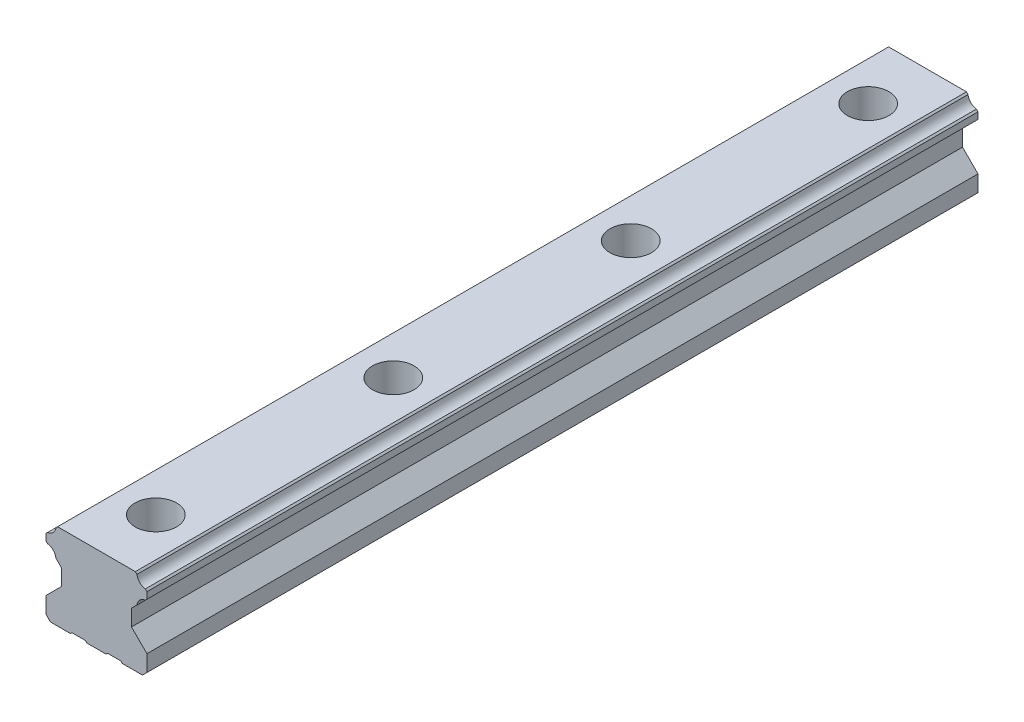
ISO-10303-21;
HEADER;
FILE_DESCRIPTION(('STEP AP214'),'2;1');
FILE_NAME('part.step','',(''),(''),'','','');
FILE_SCHEMA(('AUTOMOTIVE_DESIGN { 1 0 10303 214 1 1 1 1 }'));
ENDSEC;
DATA;
#1=APPLICATION_CONTEXT('core data for automotive mechanical design processes');
#2=APPLICATION_PROTOCOL_DEFINITION('international standard','automotive_design',2000,#1);
#3=PRODUCT_CONTEXT('',#1,'mechanical');
#4=PRODUCT('Part','Part','',(#3));
#5=PRODUCT_RELATED_PRODUCT_CATEGORY('part','',(#4));
#6=PRODUCT_DEFINITION_FORMATION('','',#4);
#7=PRODUCT_DEFINITION_CONTEXT('part definition',#1,'design');
#8=PRODUCT_DEFINITION('design','',#6,#7);
#9=PRODUCT_DEFINITION_SHAPE('','',#8);
#10=(LENGTH_UNIT() NAMED_UNIT(*) SI_UNIT(.MILLI.,.METRE.));
#11=(NAMED_UNIT(*) PLANE_ANGLE_UNIT() SI_UNIT($,.RADIAN.));
#12=(NAMED_UNIT(*) SI_UNIT($,.STERADIAN.) SOLID_ANGLE_UNIT());
#13=UNCERTAINTY_MEASURE_WITH_UNIT(LENGTH_MEASURE(1.E-05),#10,'distance_accuracy_value','');
#14=(GEOMETRIC_REPRESENTATION_CONTEXT(3) GLOBAL_UNCERTAINTY_ASSIGNED_CONTEXT((#13)) GLOBAL_UNIT_ASSIGNED_CONTEXT((#10,
#11,#12)) REPRESENTATION_CONTEXT('',''));
#15=CARTESIAN_POINT('',(0.,0.,0.));
#16=DIRECTION('',(0.,0.,1.));
#17=DIRECTION('',(1.,0.,0.));
#18=AXIS2_PLACEMENT_3D('',#15,#16,#17);
#19=CARTESIAN_POINT('',(-3.25,0.,140.));
#20=DIRECTION('',(0.,1.,0.));
#21=DIRECTION('',(0.,0.,1.));
#22=AXIS2_PLACEMENT_3D('',#19,#20,#21);
#23=PLANE('',#22);
#24=DIRECTION('',(0.,0.,-1.));
#25=VECTOR('',#24,1.);
#26=CARTESIAN_POINT('',(3.25,0.,140.));
#27=LINE('',#26,#25);
#28=CARTESIAN_POINT('',(3.25,0.,-123.112474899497));
#29=VERTEX_POINT('',#28);
#30=CARTESIAN_POINT('',(3.25,0.,-140.));
#31=VERTEX_POINT('',#30);
#32=EDGE_CURVE('E361',#29,#31,#27,.T.);
#33=ORIENTED_EDGE('',*,*,#32,.F.);
#34=CARTESIAN_POINT('',(0.,0.,-120.));
#35=DIRECTION('',(0.,1.,0.));
#36=DIRECTION('',(0.,0.,1.));
#37=AXIS2_PLACEMENT_3D('',#34,#35,#36);
#38=CIRCLE('',#37,4.49999999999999);
#39=CARTESIAN_POINT('',(-3.25,0.,-123.112474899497));
#40=VERTEX_POINT('',#39);
#41=EDGE_CURVE('E354',#29,#40,#38,.T.);
#42=ORIENTED_EDGE('',*,*,#41,.T.);
#43=DIRECTION('',(0.,0.,-1.));
#44=VECTOR('',#43,1.);
#45=CARTESIAN_POINT('',(-3.25,0.,140.));
#46=LINE('',#45,#44);
#47=CARTESIAN_POINT('',(-3.25,0.,-140.));
#48=VERTEX_POINT('',#47);
#49=EDGE_CURVE('E370',#40,#48,#46,.T.);
#50=ORIENTED_EDGE('',*,*,#49,.T.);
#51=DIRECTION('',(1.,0.,0.));
#52=VECTOR('',#51,1.);
#53=CARTESIAN_POINT('',(-3.25,0.,-140.));
#54=LINE('',#53,#52);
#55=EDGE_CURVE('E457',#48,#31,#54,.T.);
#56=ORIENTED_EDGE('',*,*,#55,.T.);
#57=EDGE_LOOP('',(#33,#42,#50,#56));
#58=FACE_BOUND('',#57,.T.);
#59=ADVANCED_FACE('F35',(#58),#23,.F.);
#60=CARTESIAN_POINT('',(-13.1101589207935,28.9999999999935,140.));
#61=DIRECTION('',(0.,-1.,0.));
#62=DIRECTION('',(0.,0.,-1.));
#63=AXIS2_PLACEMENT_3D('',#60,#61,#62);
#64=PLANE('',#63);
#65=CARTESIAN_POINT('',(0.,28.9999999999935,-40.));
#66=DIRECTION('',(0.,1.,0.));
#67=DIRECTION('',(0.,0.,1.));
#68=AXIS2_PLACEMENT_3D('',#65,#66,#67);
#69=CIRCLE('',#68,7.);
#70=CARTESIAN_POINT('',(0.,28.9999999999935,-33.));
#71=VERTEX_POINT('',#70);
#72=EDGE_CURVE('E876',#71,#71,#69,.T.);
#73=ORIENTED_EDGE('',*,*,#72,.F.);
#74=EDGE_LOOP('',(#73));
#75=FACE_BOUND('',#74,.T.);
#76=CARTESIAN_POINT('',(0.,28.9999999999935,40.));
#77=DIRECTION('',(0.,1.,0.));
#78=DIRECTION('',(0.,0.,1.));
#79=AXIS2_PLACEMENT_3D('',#76,#77,#78);
#80=CIRCLE('',#79,7.);
#81=CARTESIAN_POINT('',(0.,28.9999999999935,47.));
#82=VERTEX_POINT('',#81);
#83=EDGE_CURVE('E582',#82,#82,#80,.T.);
#84=ORIENTED_EDGE('',*,*,#83,.F.);
#85=EDGE_LOOP('',(#84));
#86=FACE_BOUND('',#85,.T.);
#87=CARTESIAN_POINT('',(0.,28.9999999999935,120.));
#88=DIRECTION('',(0.,1.,0.));
#89=DIRECTION('',(0.,0.,1.));
#90=AXIS2_PLACEMENT_3D('',#87,#88,#89);
#91=CIRCLE('',#90,7.);
#92=CARTESIAN_POINT('',(0.,28.9999999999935,127.));
#93=VERTEX_POINT('',#92);
#94=EDGE_CURVE('E607',#93,#93,#91,.T.);
#95=ORIENTED_EDGE('',*,*,#94,.F.);
#96=EDGE_LOOP('',(#95));
#97=FACE_BOUND('',#96,.T.);
#98=DIRECTION('',(-1.,0.,0.));
#99=VECTOR('',#98,1.);
#100=CARTESIAN_POINT('',(-13.1101589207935,28.9999999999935,-140.));
#101=LINE('',#100,#99);
#102=CARTESIAN_POINT('',(13.1101589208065,28.9999999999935,-140.));
#103=VERTEX_POINT('',#102);
#104=CARTESIAN_POINT('',(-13.1101589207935,28.9999999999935,-140.));
#105=VERTEX_POINT('',#104);
#106=EDGE_CURVE('E504',#103,#105,#101,.T.);
#107=ORIENTED_EDGE('',*,*,#106,.T.);
#108=DIRECTION('',(0.,0.,-1.));
#109=VECTOR('',#108,1.);
#110=CARTESIAN_POINT('',(-13.1101589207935,28.9999999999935,140.));
#111=LINE('',#110,#109);
#112=CARTESIAN_POINT('',(-13.1101589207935,28.9999999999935,140.));
#113=VERTEX_POINT('',#112);
#114=EDGE_CURVE('E512',#113,#105,#111,.T.);
#115=ORIENTED_EDGE('',*,*,#114,.F.);
#116=DIRECTION('',(-1.,0.,0.));
#117=VECTOR('',#116,1.);
#118=CARTESIAN_POINT('',(-13.1101589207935,28.9999999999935,140.));
#119=LINE('',#118,#117);
#120=CARTESIAN_POINT('',(13.1101589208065,28.9999999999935,140.));
#121=VERTEX_POINT('',#120);
#122=EDGE_CURVE('E689',#121,#113,#119,.T.);
#123=ORIENTED_EDGE('',*,*,#122,.F.);
#124=DIRECTION('',(0.,0.,-1.));
#125=VECTOR('',#124,1.);
#126=CARTESIAN_POINT('',(13.1101589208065,28.9999999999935,140.));
#127=LINE('',#126,#125);
#128=EDGE_CURVE('E516',#121,#103,#127,.T.);
#129=ORIENTED_EDGE('',*,*,#128,.T.);
#130=EDGE_LOOP('',(#107,#115,#123,#129));
#131=FACE_BOUND('',#130,.T.);
#132=CARTESIAN_POINT('',(0.,28.9999999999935,-120.));
#133=DIRECTION('',(0.,1.,0.));
#134=DIRECTION('',(0.,0.,1.));
#135=AXIS2_PLACEMENT_3D('',#132,#133,#134);
#136=CIRCLE('',#135,7.);
#137=CARTESIAN_POINT('',(0.,28.9999999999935,-113.));
#138=VERTEX_POINT('',#137);
#139=EDGE_CURVE('E1139',#138,#138,#136,.T.);
#140=ORIENTED_EDGE('',*,*,#139,.F.);
#141=EDGE_LOOP('',(#140));
#142=FACE_BOUND('',#141,.T.);
#143=ADVANCED_FACE('F786',(#75,#86,#97,#131,#142),#64,.F.);
#144=CARTESIAN_POINT('',(3.75,0.5,140.));
#145=DIRECTION('',(-0.707106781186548,0.707106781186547,0.));
#146=DIRECTION('',(-0.707106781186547,-0.707106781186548,0.));
#147=AXIS2_PLACEMENT_3D('',#144,#145,#146);
#148=PLANE('',#147);
#149=DIRECTION('',(0.,0.,-1.));
#150=VECTOR('',#149,1.);
#151=CARTESIAN_POINT('',(3.75,0.5,140.));
#152=LINE('',#151,#150);
#153=CARTESIAN_POINT('',(3.75,0.5,-122.487468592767));
#154=VERTEX_POINT('',#153);
#155=CARTESIAN_POINT('',(3.75,0.5,-140.));
#156=VERTEX_POINT('',#155);
#157=EDGE_CURVE('E556',#154,#156,#152,.T.);
#158=ORIENTED_EDGE('',*,*,#157,.F.);
#159=CARTESIAN_POINT('',(0.,-3.25,-120.));
#160=DIRECTION('',(-0.707106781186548,0.707106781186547,0.));
#161=DIRECTION('',(0.707106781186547,0.707106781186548,0.));
#162=AXIS2_PLACEMENT_3D('',#159,#160,#161);
#163=ELLIPSE('',#162,6.36396103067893,4.5);
#164=EDGE_CURVE('E11',#154,#29,#163,.T.);
#165=ORIENTED_EDGE('',*,*,#164,.T.);
#166=ORIENTED_EDGE('',*,*,#32,.T.);
#167=DIRECTION('',(0.707106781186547,0.707106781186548,0.));
#168=VECTOR('',#167,1.);
#169=CARTESIAN_POINT('',(3.75,0.5,-140.));
#170=LINE('',#169,#168);
#171=EDGE_CURVE('E471',#31,#156,#170,.T.);
#172=ORIENTED_EDGE('',*,*,#171,.T.);
#173=EDGE_LOOP('',(#158,#165,#166,#172));
#174=FACE_BOUND('',#173,.T.);
#175=ADVANCED_FACE('F909',(#174),#148,.F.);
#176=CARTESIAN_POINT('',(-3.25,0.,140.));
#177=DIRECTION('',(0.707106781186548,0.707106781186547,0.));
#178=DIRECTION('',(-0.707106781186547,0.707106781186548,0.));
#179=AXIS2_PLACEMENT_3D('',#176,#177,#178);
#180=PLANE('',#179);
#181=DIRECTION('',(0.,0.,-1.));
#182=VECTOR('',#181,1.);
#183=CARTESIAN_POINT('',(-3.75,0.5,140.));
#184=LINE('',#183,#182);
#185=CARTESIAN_POINT('',(-3.75,0.5,-42.4874685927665));
#186=VERTEX_POINT('',#185);
#187=CARTESIAN_POINT('',(-3.75,0.5,-117.512531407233));
#188=VERTEX_POINT('',#187);
#189=EDGE_CURVE('E870',#186,#188,#184,.T.);
#190=ORIENTED_EDGE('',*,*,#189,.T.);
#191=CARTESIAN_POINT('',(0.,-3.25000000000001,-120.));
#192=DIRECTION('',(0.707106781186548,0.707106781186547,0.));
#193=DIRECTION('',(-0.707106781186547,0.707106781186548,0.));
#194=AXIS2_PLACEMENT_3D('',#191,#192,#193);
#195=ELLIPSE('',#194,6.36396103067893,4.5);
#196=CARTESIAN_POINT('',(-3.25,0.,-116.887525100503));
#197=VERTEX_POINT('',#196);
#198=EDGE_CURVE('E345',#188,#197,#195,.T.);
#199=ORIENTED_EDGE('',*,*,#198,.T.);
#200=CARTESIAN_POINT('',(-3.25,0.,-43.1124748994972));
#201=VERTEX_POINT('',#200);
#202=EDGE_CURVE('E353',#201,#197,#46,.T.);
#203=ORIENTED_EDGE('',*,*,#202,.F.);
#204=CARTESIAN_POINT('',(0.,-3.25000000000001,-40.));
#205=DIRECTION('',(0.707106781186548,0.707106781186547,0.));
#206=DIRECTION('',(-0.707106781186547,0.707106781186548,0.));
#207=AXIS2_PLACEMENT_3D('',#204,#205,#206);
#208=ELLIPSE('',#207,6.36396103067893,4.5);
#209=EDGE_CURVE('E425',#201,#186,#208,.T.);
#210=ORIENTED_EDGE('',*,*,#209,.T.);
#211=EDGE_LOOP('',(#190,#199,#203,#210));
#212=FACE_BOUND('',#211,.T.);
#213=ADVANCED_FACE('F874',(#212),#180,.F.);
#214=CARTESIAN_POINT('',(3.25,0.,-43.1124748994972));
#215=VERTEX_POINT('',#214);
#216=CARTESIAN_POINT('',(3.25,0.,-116.887525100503));
#217=VERTEX_POINT('',#216);
#218=EDGE_CURVE('E351',#215,#217,#27,.T.);
#219=ORIENTED_EDGE('',*,*,#218,.T.);
#220=CARTESIAN_POINT('',(3.75,0.5,-117.512531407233));
#221=VERTEX_POINT('',#220);
#222=EDGE_CURVE('E39',#217,#221,#163,.T.);
#223=ORIENTED_EDGE('',*,*,#222,.T.);
#224=CARTESIAN_POINT('',(3.75,0.5,-42.4874685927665));
#225=VERTEX_POINT('',#224);
#226=EDGE_CURVE('E561',#225,#221,#152,.T.);
#227=ORIENTED_EDGE('',*,*,#226,.F.);
#228=CARTESIAN_POINT('',(0.,-3.25,-40.));
#229=DIRECTION('',(-0.707106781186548,0.707106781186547,0.));
#230=DIRECTION('',(0.707106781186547,0.707106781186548,0.));
#231=AXIS2_PLACEMENT_3D('',#228,#229,#230);
#232=ELLIPSE('',#231,6.36396103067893,4.5);
#233=EDGE_CURVE('E359',#225,#215,#232,.T.);
#234=ORIENTED_EDGE('',*,*,#233,.T.);
#235=EDGE_LOOP('',(#219,#223,#227,#234));
#236=FACE_BOUND('',#235,.T.);
#237=ADVANCED_FACE('F358',(#236),#148,.F.);
#238=CARTESIAN_POINT('',(-3.75,0.5,37.5125314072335));
#239=VERTEX_POINT('',#238);
#240=CARTESIAN_POINT('',(-3.75,0.5,-37.5125314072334));
#241=VERTEX_POINT('',#240);
#242=EDGE_CURVE('E443',#239,#241,#184,.T.);
#243=ORIENTED_EDGE('',*,*,#242,.T.);
#244=CARTESIAN_POINT('',(-3.25,0.,-36.8875251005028));
#245=VERTEX_POINT('',#244);
#246=EDGE_CURVE('E427',#241,#245,#208,.T.);
#247=ORIENTED_EDGE('',*,*,#246,.T.);
#248=CARTESIAN_POINT('',(-3.25,0.,36.8875251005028));
#249=VERTEX_POINT('',#248);
#250=EDGE_CURVE('E441',#249,#245,#46,.T.);
#251=ORIENTED_EDGE('',*,*,#250,.F.);
#252=CARTESIAN_POINT('',(0.,-3.25000000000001,40.));
#253=DIRECTION('',(0.707106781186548,0.707106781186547,0.));
#254=DIRECTION('',(-0.707106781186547,0.707106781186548,0.));
#255=AXIS2_PLACEMENT_3D('',#252,#253,#254);
#256=ELLIPSE('',#255,6.36396103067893,4.5);
#257=EDGE_CURVE('E604',#249,#239,#256,.T.);
#258=ORIENTED_EDGE('',*,*,#257,.T.);
#259=EDGE_LOOP('',(#243,#247,#251,#258));
#260=FACE_BOUND('',#259,.T.);
#261=ADVANCED_FACE('F439',(#260),#180,.F.);
#262=ORIENTED_EDGE('',*,*,#202,.T.);
#263=EDGE_CURVE('E339',#197,#217,#38,.T.);
#264=ORIENTED_EDGE('',*,*,#263,.T.);
#265=ORIENTED_EDGE('',*,*,#218,.F.);
#266=CARTESIAN_POINT('',(0.,0.,-40.));
#267=DIRECTION('',(0.,1.,0.));
#268=DIRECTION('',(0.,0.,1.));
#269=AXIS2_PLACEMENT_3D('',#266,#267,#268);
#270=CIRCLE('',#269,4.49999999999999);
#271=EDGE_CURVE('E428',#215,#201,#270,.T.);
#272=ORIENTED_EDGE('',*,*,#271,.T.);
#273=EDGE_LOOP('',(#262,#264,#265,#272));
#274=FACE_BOUND('',#273,.T.);
#275=ADVANCED_FACE('F349',(#274),#23,.F.);
#276=CARTESIAN_POINT('',(-3.75,0.5,117.512531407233));
#277=VERTEX_POINT('',#276);
#278=CARTESIAN_POINT('',(-3.75,0.5,42.4874685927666));
#279=VERTEX_POINT('',#278);
#280=EDGE_CURVE('E381',#277,#279,#184,.T.);
#281=ORIENTED_EDGE('',*,*,#280,.T.);
#282=CARTESIAN_POINT('',(-3.25,0.,43.1124748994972));
#283=VERTEX_POINT('',#282);
#284=EDGE_CURVE('E606',#279,#283,#256,.T.);
#285=ORIENTED_EDGE('',*,*,#284,.T.);
#286=CARTESIAN_POINT('',(-3.25000000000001,0.,116.887525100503));
#287=VERTEX_POINT('',#286);
#288=EDGE_CURVE('E376',#287,#283,#46,.T.);
#289=ORIENTED_EDGE('',*,*,#288,.F.);
#290=CARTESIAN_POINT('',(0.,-3.25000000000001,120.));
#291=DIRECTION('',(0.707106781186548,0.707106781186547,0.));
#292=DIRECTION('',(-0.707106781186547,0.707106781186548,0.));
#293=AXIS2_PLACEMENT_3D('',#290,#291,#292);
#294=ELLIPSE('',#293,6.36396103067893,4.5);
#295=EDGE_CURVE('E622',#287,#277,#294,.T.);
#296=ORIENTED_EDGE('',*,*,#295,.T.);
#297=EDGE_LOOP('',(#281,#285,#289,#296));
#298=FACE_BOUND('',#297,.T.);
#299=ADVANCED_FACE('F915',(#298),#180,.F.);
#300=ORIENTED_EDGE('',*,*,#250,.T.);
#301=CARTESIAN_POINT('',(3.25,0.,-36.8875251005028));
#302=VERTEX_POINT('',#301);
#303=EDGE_CURVE('E424',#245,#302,#270,.T.);
#304=ORIENTED_EDGE('',*,*,#303,.T.);
#305=CARTESIAN_POINT('',(3.25,0.,36.8875251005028));
#306=VERTEX_POINT('',#305);
#307=EDGE_CURVE('E360',#306,#302,#27,.T.);
#308=ORIENTED_EDGE('',*,*,#307,.F.);
#309=CARTESIAN_POINT('',(0.,0.,40.));
#310=DIRECTION('',(0.,1.,0.));
#311=DIRECTION('',(0.,0.,1.));
#312=AXIS2_PLACEMENT_3D('',#309,#310,#311);
#313=CIRCLE('',#312,4.49999999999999);
#314=EDGE_CURVE('E449',#306,#249,#313,.T.);
#315=ORIENTED_EDGE('',*,*,#314,.T.);
#316=EDGE_LOOP('',(#300,#304,#308,#315));
#317=FACE_BOUND('',#316,.T.);
#318=ADVANCED_FACE('F447',(#317),#23,.F.);
#319=ORIENTED_EDGE('',*,*,#307,.T.);
#320=CARTESIAN_POINT('',(3.75,0.5,-37.5125314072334));
#321=VERTEX_POINT('',#320);
#322=EDGE_CURVE('E58',#302,#321,#232,.T.);
#323=ORIENTED_EDGE('',*,*,#322,.T.);
#324=CARTESIAN_POINT('',(3.75,0.5,37.5125314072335));
#325=VERTEX_POINT('',#324);
#326=EDGE_CURVE('E564',#325,#321,#152,.T.);
#327=ORIENTED_EDGE('',*,*,#326,.F.);
#328=CARTESIAN_POINT('',(0.,-3.25,40.));
#329=DIRECTION('',(-0.707106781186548,0.707106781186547,0.));
#330=DIRECTION('',(0.707106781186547,0.707106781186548,0.));
#331=AXIS2_PLACEMENT_3D('',#328,#329,#330);
#332=ELLIPSE('',#331,6.36396103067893,4.5);
#333=EDGE_CURVE('E580',#325,#306,#332,.T.);
#334=ORIENTED_EDGE('',*,*,#333,.T.);
#335=EDGE_LOOP('',(#319,#323,#327,#334));
#336=FACE_BOUND('',#335,.T.);
#337=ADVANCED_FACE('F579',(#336),#148,.F.);
#338=ORIENTED_EDGE('',*,*,#288,.T.);
#339=CARTESIAN_POINT('',(3.25,0.,43.1124748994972));
#340=VERTEX_POINT('',#339);
#341=EDGE_CURVE('E595',#283,#340,#313,.T.);
#342=ORIENTED_EDGE('',*,*,#341,.T.);
#343=CARTESIAN_POINT('',(3.25,0.,116.887525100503));
#344=VERTEX_POINT('',#343);
#345=EDGE_CURVE('E364',#344,#340,#27,.T.);
#346=ORIENTED_EDGE('',*,*,#345,.F.);
#347=CARTESIAN_POINT('',(0.,0.,120.));
#348=DIRECTION('',(0.,1.,0.));
#349=DIRECTION('',(0.,0.,1.));
#350=AXIS2_PLACEMENT_3D('',#347,#348,#349);
#351=CIRCLE('',#350,4.49999999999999);
#352=EDGE_CURVE('E619',#344,#287,#351,.T.);
#353=ORIENTED_EDGE('',*,*,#352,.T.);
#354=EDGE_LOOP('',(#338,#342,#346,#353));
#355=FACE_BOUND('',#354,.T.);
#356=ADVANCED_FACE('F917',(#355),#23,.F.);
#357=CARTESIAN_POINT('',(-3.75,0.5,140.));
#358=VERTEX_POINT('',#357);
#359=CARTESIAN_POINT('',(-3.75,0.5,122.487468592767));
#360=VERTEX_POINT('',#359);
#361=EDGE_CURVE('E377',#358,#360,#184,.T.);
#362=ORIENTED_EDGE('',*,*,#361,.T.);
#363=CARTESIAN_POINT('',(-3.25000000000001,0.,123.112474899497));
#364=VERTEX_POINT('',#363);
#365=EDGE_CURVE('E626',#360,#364,#294,.T.);
#366=ORIENTED_EDGE('',*,*,#365,.T.);
#367=CARTESIAN_POINT('',(-3.25,0.,140.));
#368=VERTEX_POINT('',#367);
#369=EDGE_CURVE('E372',#368,#364,#46,.T.);
#370=ORIENTED_EDGE('',*,*,#369,.F.);
#371=DIRECTION('',(0.707106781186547,-0.707106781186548,0.));
#372=VECTOR('',#371,1.);
#373=CARTESIAN_POINT('',(-3.25,0.,140.));
#374=LINE('',#373,#372);
#375=EDGE_CURVE('E655',#358,#368,#374,.T.);
#376=ORIENTED_EDGE('',*,*,#375,.F.);
#377=EDGE_LOOP('',(#362,#366,#370,#376));
#378=FACE_BOUND('',#377,.T.);
#379=ADVANCED_FACE('F864',(#378),#180,.F.);
#380=ORIENTED_EDGE('',*,*,#345,.T.);
#381=CARTESIAN_POINT('',(3.75,0.5,42.4874685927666));
#382=VERTEX_POINT('',#381);
#383=EDGE_CURVE('E598',#340,#382,#332,.T.);
#384=ORIENTED_EDGE('',*,*,#383,.T.);
#385=CARTESIAN_POINT('',(3.75,0.5,117.512531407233));
#386=VERTEX_POINT('',#385);
#387=EDGE_CURVE('E566',#386,#382,#152,.T.);
#388=ORIENTED_EDGE('',*,*,#387,.F.);
#389=CARTESIAN_POINT('',(0.,-3.25,120.));
#390=DIRECTION('',(-0.707106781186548,0.707106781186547,0.));
#391=DIRECTION('',(0.707106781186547,0.707106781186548,0.));
#392=AXIS2_PLACEMENT_3D('',#389,#390,#391);
#393=ELLIPSE('',#392,6.36396103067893,4.5);
#394=EDGE_CURVE('E420',#386,#344,#393,.T.);
#395=ORIENTED_EDGE('',*,*,#394,.T.);
#396=EDGE_LOOP('',(#380,#384,#388,#395));
#397=FACE_BOUND('',#396,.T.);
#398=ADVANCED_FACE('F922',(#397),#148,.F.);
#399=CARTESIAN_POINT('',(-16.9101562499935,28.9118652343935,140.));
#400=DIRECTION('',(0.,0.,-1.));
#401=DIRECTION('',(-1.,0.,0.));
#402=AXIS2_PLACEMENT_3D('',#399,#400,#401);
#403=CYLINDRICAL_SURFACE('',#402,3.29999923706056);
#404=CARTESIAN_POINT('',(-16.9101562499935,28.9118652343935,-140.));
#405=DIRECTION('',(0.,0.,-1.));
#406=DIRECTION('',(1.,0.,0.));
#407=AXIS2_PLACEMENT_3D('',#404,#405,#406);
#408=CIRCLE('',#407,3.29999923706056);
#409=CARTESIAN_POINT('',(-13.6398289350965,28.4703290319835,-140.));
#410=VERTEX_POINT('',#409);
#411=CARTESIAN_POINT('',(-16.4686211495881,25.6415377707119,-140.));
#412=VERTEX_POINT('',#411);
#413=EDGE_CURVE('E692',#410,#412,#408,.T.);
#414=ORIENTED_EDGE('',*,*,#413,.T.);
#415=DIRECTION('',(0.,0.,-1.));
#416=VECTOR('',#415,1.);
#417=CARTESIAN_POINT('',(-16.4686211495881,25.6415377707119,140.));
#418=LINE('',#417,#416);
#419=CARTESIAN_POINT('',(-16.4686211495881,25.6415377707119,140.));
#420=VERTEX_POINT('',#419);
#421=EDGE_CURVE('E414',#420,#412,#418,.T.);
#422=ORIENTED_EDGE('',*,*,#421,.F.);
#423=CARTESIAN_POINT('',(-16.9101562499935,28.9118652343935,140.));
#424=DIRECTION('',(0.,0.,-1.));
#425=DIRECTION('',(1.,0.,0.));
#426=AXIS2_PLACEMENT_3D('',#423,#424,#425);
#427=CIRCLE('',#426,3.29999923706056);
#428=CARTESIAN_POINT('',(-13.6398289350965,28.4703290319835,140.));
#429=VERTEX_POINT('',#428);
#430=EDGE_CURVE('E508',#429,#420,#427,.T.);
#431=ORIENTED_EDGE('',*,*,#430,.F.);
#432=DIRECTION('',(0.,0.,-1.));
#433=VECTOR('',#432,1.);
#434=CARTESIAN_POINT('',(-13.6398289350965,28.4703290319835,140.));
#435=LINE('',#434,#433);
#436=EDGE_CURVE('E509',#429,#410,#435,.T.);
#437=ORIENTED_EDGE('',*,*,#436,.T.);
#438=EDGE_LOOP('',(#414,#422,#431,#437));
#439=FACE_BOUND('',#438,.T.);
#440=ADVANCED_FACE('F37',(#439),#403,.F.);
#441=CARTESIAN_POINT('',(-17.,25.1101589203,140.));
#442=DIRECTION('',(0.707106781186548,-0.707106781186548,0.));
#443=DIRECTION('',(0.707106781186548,0.707106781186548,0.));
#444=AXIS2_PLACEMENT_3D('',#441,#442,#443);
#445=PLANE('',#444);
#446=DIRECTION('',(-0.707106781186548,-0.707106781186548,0.));
#447=VECTOR('',#446,1.);
#448=CARTESIAN_POINT('',(-17.,25.1101589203,-140.));
#449=LINE('',#448,#447);
#450=CARTESIAN_POINT('',(-17.,25.1101589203,-140.));
#451=VERTEX_POINT('',#450);
#452=EDGE_CURVE('E695',#412,#451,#449,.T.);
#453=ORIENTED_EDGE('',*,*,#452,.T.);
#454=DIRECTION('',(0.,0.,-1.));
#455=VECTOR('',#454,1.);
#456=CARTESIAN_POINT('',(-17.,25.1101589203,140.));
#457=LINE('',#456,#455);
#458=CARTESIAN_POINT('',(-17.,25.1101589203,140.));
#459=VERTEX_POINT('',#458);
#460=EDGE_CURVE('E411',#459,#451,#457,.T.);
#461=ORIENTED_EDGE('',*,*,#460,.F.);
#462=DIRECTION('',(-0.707106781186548,-0.707106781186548,0.));
#463=VECTOR('',#462,1.);
#464=CARTESIAN_POINT('',(-17.,25.1101589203,140.));
#465=LINE('',#464,#463);
#466=EDGE_CURVE('E631',#420,#459,#465,.T.);
#467=ORIENTED_EDGE('',*,*,#466,.F.);
#468=ORIENTED_EDGE('',*,*,#421,.T.);
#469=EDGE_LOOP('',(#453,#461,#467,#468));
#470=FACE_BOUND('',#469,.T.);
#471=ADVANCED_FACE('F772',(#470),#445,.F.);
#472=CARTESIAN_POINT('',(-17.,25.1101589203,140.));
#473=DIRECTION('',(1.,0.,0.));
#474=DIRECTION('',(0.,0.,-1.));
#475=AXIS2_PLACEMENT_3D('',#472,#473,#474);
#476=PLANE('',#475);
#477=DIRECTION('',(0.,-1.,0.));
#478=VECTOR('',#477,1.);
#479=CARTESIAN_POINT('',(-17.,25.1101589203,-140.));
#480=LINE('',#479,#478);
#481=CARTESIAN_POINT('',(-17.,22.8792915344,-140.));
#482=VERTEX_POINT('',#481);
#483=EDGE_CURVE('E697',#451,#482,#480,.T.);
#484=ORIENTED_EDGE('',*,*,#483,.T.);
#485=DIRECTION('',(0.,0.,-1.));
#486=VECTOR('',#485,1.);
#487=CARTESIAN_POINT('',(-17.,22.8792915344,140.));
#488=LINE('',#487,#486);
#489=CARTESIAN_POINT('',(-17.,22.8792915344,140.));
#490=VERTEX_POINT('',#489);
#491=EDGE_CURVE('E408',#490,#482,#488,.T.);
#492=ORIENTED_EDGE('',*,*,#491,.F.);
#493=DIRECTION('',(0.,-1.,0.));
#494=VECTOR('',#493,1.);
#495=CARTESIAN_POINT('',(-17.,25.1101589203,140.));
#496=LINE('',#495,#494);
#497=EDGE_CURVE('E633',#459,#490,#496,.T.);
#498=ORIENTED_EDGE('',*,*,#497,.F.);
#499=ORIENTED_EDGE('',*,*,#460,.T.);
#500=EDGE_LOOP('',(#484,#492,#498,#499));
#501=FACE_BOUND('',#500,.T.);
#502=ADVANCED_FACE('F768',(#501),#476,.F.);
#503=CARTESIAN_POINT('',(-16.4816336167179,22.3609251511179,140.));
#504=DIRECTION('',(0.70710678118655,0.707106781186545,0.));
#505=DIRECTION('',(-0.707106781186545,0.70710678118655,0.));
#506=AXIS2_PLACEMENT_3D('',#503,#504,#505);
#507=PLANE('',#506);
#508=DIRECTION('',(0.707106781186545,-0.70710678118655,0.));
#509=VECTOR('',#508,1.);
#510=CARTESIAN_POINT('',(-16.4816336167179,22.3609251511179,-140.));
#511=LINE('',#510,#509);
#512=CARTESIAN_POINT('',(-16.4816336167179,22.3609251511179,-140.));
#513=VERTEX_POINT('',#512);
#514=EDGE_CURVE('E699',#482,#513,#511,.T.);
#515=ORIENTED_EDGE('',*,*,#514,.T.);
#516=DIRECTION('',(0.,0.,-1.));
#517=VECTOR('',#516,1.);
#518=CARTESIAN_POINT('',(-16.4816336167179,22.3609251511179,140.));
#519=LINE('',#518,#517);
#520=CARTESIAN_POINT('',(-16.4816336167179,22.3609251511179,140.));
#521=VERTEX_POINT('',#520);
#522=EDGE_CURVE('E405',#521,#513,#519,.T.);
#523=ORIENTED_EDGE('',*,*,#522,.F.);
#524=DIRECTION('',(0.707106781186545,-0.70710678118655,0.));
#525=VECTOR('',#524,1.);
#526=CARTESIAN_POINT('',(-16.4816336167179,22.3609251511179,140.));
#527=LINE('',#526,#525);
#528=EDGE_CURVE('E635',#490,#521,#527,.T.);
#529=ORIENTED_EDGE('',*,*,#528,.F.);
#530=ORIENTED_EDGE('',*,*,#491,.T.);
#531=EDGE_LOOP('',(#515,#523,#529,#530));
#532=FACE_BOUND('',#531,.T.);
#533=ADVANCED_FACE('F764',(#532),#507,.F.);
#534=CARTESIAN_POINT('',(-16.9101562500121,19.0888671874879,140.));
#535=DIRECTION('',(0.,0.,-1.));
#536=DIRECTION('',(-1.,0.,0.));
#537=AXIS2_PLACEMENT_3D('',#534,#535,#536);
#538=CYLINDRICAL_SURFACE('',#537,3.29999923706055);
#539=CARTESIAN_POINT('',(-16.9101562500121,19.0888671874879,-140.));
#540=DIRECTION('',(0.,0.,-1.));
#541=DIRECTION('',(1.,0.,0.));
#542=AXIS2_PLACEMENT_3D('',#539,#540,#541);
#543=CIRCLE('',#542,3.29999923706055);
#544=CARTESIAN_POINT('',(-13.6380982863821,19.5173898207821,-140.));
#545=VERTEX_POINT('',#544);
#546=EDGE_CURVE('E701',#513,#545,#543,.T.);
#547=ORIENTED_EDGE('',*,*,#546,.T.);
#548=DIRECTION('',(0.,0.,-1.));
#549=VECTOR('',#548,1.);
#550=CARTESIAN_POINT('',(-13.6380982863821,19.5173898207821,140.));
#551=LINE('',#550,#549);
#552=CARTESIAN_POINT('',(-13.6380982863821,19.5173898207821,140.));
#553=VERTEX_POINT('',#552);
#554=EDGE_CURVE('E402',#553,#545,#551,.T.);
#555=ORIENTED_EDGE('',*,*,#554,.F.);
#556=CARTESIAN_POINT('',(-16.9101562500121,19.0888671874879,140.));
#557=DIRECTION('',(0.,0.,-1.));
#558=DIRECTION('',(1.,0.,0.));
#559=AXIS2_PLACEMENT_3D('',#556,#557,#558);
#560=CIRCLE('',#559,3.29999923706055);
#561=EDGE_CURVE('E637',#521,#553,#560,.T.);
#562=ORIENTED_EDGE('',*,*,#561,.F.);
#563=ORIENTED_EDGE('',*,*,#522,.T.);
#564=EDGE_LOOP('',(#547,#555,#562,#563));
#565=FACE_BOUND('',#564,.T.);
#566=ADVANCED_FACE('F760',(#565),#538,.F.);
#567=CARTESIAN_POINT('',(-13.6380982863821,19.5173898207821,140.));
#568=DIRECTION('',(0.707106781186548,0.707106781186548,0.));
#569=DIRECTION('',(-0.707106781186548,0.707106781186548,0.));
#570=AXIS2_PLACEMENT_3D('',#567,#568,#569);
#571=PLANE('',#570);
#572=DIRECTION('',(0.707106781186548,-0.707106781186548,0.));
#573=VECTOR('',#572,1.);
#574=CARTESIAN_POINT('',(-13.6380982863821,19.5173898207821,-140.));
#575=LINE('',#574,#573);
#576=CARTESIAN_POINT('',(-11.8002929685,17.6795845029,-140.));
#577=VERTEX_POINT('',#576);
#578=EDGE_CURVE('E703',#545,#577,#575,.T.);
#579=ORIENTED_EDGE('',*,*,#578,.T.);
#580=DIRECTION('',(0.,0.,-1.));
#581=VECTOR('',#580,1.);
#582=CARTESIAN_POINT('',(-11.8002929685,17.6795845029,140.));
#583=LINE('',#582,#581);
#584=CARTESIAN_POINT('',(-11.8002929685,17.6795845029,140.));
#585=VERTEX_POINT('',#584);
#586=EDGE_CURVE('E399',#585,#577,#583,.T.);
#587=ORIENTED_EDGE('',*,*,#586,.F.);
#588=DIRECTION('',(0.707106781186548,-0.707106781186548,0.));
#589=VECTOR('',#588,1.);
#590=CARTESIAN_POINT('',(-13.6380982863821,19.5173898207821,140.));
#591=LINE('',#590,#589);
#592=EDGE_CURVE('E639',#553,#585,#591,.T.);
#593=ORIENTED_EDGE('',*,*,#592,.F.);
#594=ORIENTED_EDGE('',*,*,#554,.T.);
#595=EDGE_LOOP('',(#579,#587,#593,#594));
#596=FACE_BOUND('',#595,.T.);
#597=ADVANCED_FACE('F755',(#596),#571,.F.);
#598=CARTESIAN_POINT('',(-11.8002929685,17.6795845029,140.));
#599=DIRECTION('',(0.999999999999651,8.35538254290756E-07,0.));
#600=DIRECTION('',(-8.35538254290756E-07,0.999999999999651,0.));
#601=AXIS2_PLACEMENT_3D('',#598,#599,#600);
#602=PLANE('',#601);
#603=DIRECTION('',(8.35538254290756E-07,-0.999999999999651,0.));
#604=VECTOR('',#603,1.);
#605=CARTESIAN_POINT('',(-11.8002929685,17.6795845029,-140.));
#606=LINE('',#605,#604);
#607=CARTESIAN_POINT('',(-11.80028839,12.1998832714,-140.));
#608=VERTEX_POINT('',#607);
#609=EDGE_CURVE('E705',#577,#608,#606,.T.);
#610=ORIENTED_EDGE('',*,*,#609,.T.);
#611=DIRECTION('',(0.,0.,-1.));
#612=VECTOR('',#611,1.);
#613=CARTESIAN_POINT('',(-11.80028839,12.1998832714,140.));
#614=LINE('',#613,#612);
#615=CARTESIAN_POINT('',(-11.80028839,12.1998832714,140.));
#616=VERTEX_POINT('',#615);
#617=EDGE_CURVE('E396',#616,#608,#614,.T.);
#618=ORIENTED_EDGE('',*,*,#617,.F.);
#619=DIRECTION('',(8.35538254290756E-07,-0.999999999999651,0.));
#620=VECTOR('',#619,1.);
#621=CARTESIAN_POINT('',(-11.8002929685,17.6795845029,140.));
#622=LINE('',#621,#620);
#623=EDGE_CURVE('E641',#585,#616,#622,.T.);
#624=ORIENTED_EDGE('',*,*,#623,.F.);
#625=ORIENTED_EDGE('',*,*,#586,.T.);
#626=EDGE_LOOP('',(#610,#618,#624,#625));
#627=FACE_BOUND('',#626,.T.);
#628=ADVANCED_FACE('F749',(#627),#602,.F.);
#629=CARTESIAN_POINT('',(-11.80028839,12.1998832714,140.));
#630=DIRECTION('',(0.707106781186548,-0.707106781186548,0.));
#631=DIRECTION('',(0.707106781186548,0.707106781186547,0.));
#632=AXIS2_PLACEMENT_3D('',#629,#630,#631);
#633=PLANE('',#632);
#634=DIRECTION('',(-0.707106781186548,-0.707106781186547,0.));
#635=VECTOR('',#634,1.);
#636=CARTESIAN_POINT('',(-11.80028839,12.1998832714,-140.));
#637=LINE('',#636,#635);
#638=CARTESIAN_POINT('',(-17.,7.0001716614,-140.));
#639=VERTEX_POINT('',#638);
#640=EDGE_CURVE('E707',#608,#639,#637,.T.);
#641=ORIENTED_EDGE('',*,*,#640,.T.);
#642=DIRECTION('',(0.,0.,-1.));
#643=VECTOR('',#642,1.);
#644=CARTESIAN_POINT('',(-17.,7.0001716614,140.));
#645=LINE('',#644,#643);
#646=CARTESIAN_POINT('',(-17.,7.0001716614,140.));
#647=VERTEX_POINT('',#646);
#648=EDGE_CURVE('E393',#647,#639,#645,.T.);
#649=ORIENTED_EDGE('',*,*,#648,.F.);
#650=DIRECTION('',(-0.707106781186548,-0.707106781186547,0.));
#651=VECTOR('',#650,1.);
#652=CARTESIAN_POINT('',(-11.80028839,12.1998832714,140.));
#653=LINE('',#652,#651);
#654=EDGE_CURVE('E643',#616,#647,#653,.T.);
#655=ORIENTED_EDGE('',*,*,#654,.F.);
#656=ORIENTED_EDGE('',*,*,#617,.T.);
#657=EDGE_LOOP('',(#641,#649,#655,#656));
#658=FACE_BOUND('',#657,.T.);
#659=ADVANCED_FACE('F745',(#658),#633,.F.);
#660=CARTESIAN_POINT('',(-17.,7.0001716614,140.));
#661=DIRECTION('',(1.,0.,0.));
#662=DIRECTION('',(0.,0.,-1.));
#663=AXIS2_PLACEMENT_3D('',#660,#661,#662);
#664=PLANE('',#663);
#665=DIRECTION('',(0.,-1.,0.));
#666=VECTOR('',#665,1.);
#667=CARTESIAN_POINT('',(-17.,7.0001716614,-140.));
#668=LINE('',#667,#666);
#669=CARTESIAN_POINT('',(-17.,1.5,-140.));
#670=VERTEX_POINT('',#669);
#671=EDGE_CURVE('E709',#639,#670,#668,.T.);
#672=ORIENTED_EDGE('',*,*,#671,.T.);
#673=DIRECTION('',(0.,0.,-1.));
#674=VECTOR('',#673,1.);
#675=CARTESIAN_POINT('',(-17.,1.5,140.));
#676=LINE('',#675,#674);
#677=CARTESIAN_POINT('',(-17.,1.5,140.));
#678=VERTEX_POINT('',#677);
#679=EDGE_CURVE('E390',#678,#670,#676,.T.);
#680=ORIENTED_EDGE('',*,*,#679,.F.);
#681=DIRECTION('',(0.,-1.,0.));
#682=VECTOR('',#681,1.);
#683=CARTESIAN_POINT('',(-17.,7.0001716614,140.));
#684=LINE('',#683,#682);
#685=EDGE_CURVE('E645',#647,#678,#684,.T.);
#686=ORIENTED_EDGE('',*,*,#685,.F.);
#687=ORIENTED_EDGE('',*,*,#648,.T.);
#688=EDGE_LOOP('',(#672,#680,#686,#687));
#689=FACE_BOUND('',#688,.T.);
#690=ADVANCED_FACE('F740',(#689),#664,.F.);
#691=CARTESIAN_POINT('',(-17.,1.5,140.));
#692=DIRECTION('',(0.707106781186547,0.707106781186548,0.));
#693=DIRECTION('',(-0.707106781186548,0.707106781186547,0.));
#694=AXIS2_PLACEMENT_3D('',#691,#692,#693);
#695=PLANE('',#694);
#696=DIRECTION('',(0.707106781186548,-0.707106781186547,0.));
#697=VECTOR('',#696,1.);
#698=CARTESIAN_POINT('',(-17.,1.5,-140.));
#699=LINE('',#698,#697);
#700=CARTESIAN_POINT('',(-15.5,0.,-140.));
#701=VERTEX_POINT('',#700);
#702=EDGE_CURVE('E711',#670,#701,#699,.T.);
#703=ORIENTED_EDGE('',*,*,#702,.T.);
#704=DIRECTION('',(0.,0.,-1.));
#705=VECTOR('',#704,1.);
#706=CARTESIAN_POINT('',(-15.5,0.,140.));
#707=LINE('',#706,#705);
#708=CARTESIAN_POINT('',(-15.5,0.,140.));
#709=VERTEX_POINT('',#708);
#710=EDGE_CURVE('E387',#709,#701,#707,.T.);
#711=ORIENTED_EDGE('',*,*,#710,.F.);
#712=DIRECTION('',(0.707106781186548,-0.707106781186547,0.));
#713=VECTOR('',#712,1.);
#714=CARTESIAN_POINT('',(-17.,1.5,140.));
#715=LINE('',#714,#713);
#716=EDGE_CURVE('E647',#678,#709,#715,.T.);
#717=ORIENTED_EDGE('',*,*,#716,.F.);
#718=ORIENTED_EDGE('',*,*,#679,.T.);
#719=EDGE_LOOP('',(#703,#711,#717,#718));
#720=FACE_BOUND('',#719,.T.);
#721=ADVANCED_FACE('F734',(#720),#695,.F.);
#722=CARTESIAN_POINT('',(-15.5,0.,140.));
#723=DIRECTION('',(0.,1.,0.));
#724=DIRECTION('',(0.,0.,1.));
#725=AXIS2_PLACEMENT_3D('',#722,#723,#724);
#726=PLANE('',#725);
#727=DIRECTION('',(1.,0.,0.));
#728=VECTOR('',#727,1.);
#729=CARTESIAN_POINT('',(-15.5,0.,-140.));
#730=LINE('',#729,#728);
#731=CARTESIAN_POINT('',(-8.745,0.,-140.));
#732=VERTEX_POINT('',#731);
#733=EDGE_CURVE('E713',#701,#732,#730,.T.);
#734=ORIENTED_EDGE('',*,*,#733,.T.);
#735=DIRECTION('',(0.,0.,-1.));
#736=VECTOR('',#735,1.);
#737=CARTESIAN_POINT('',(-8.745,0.,140.));
#738=LINE('',#737,#736);
#739=CARTESIAN_POINT('',(-8.745,0.,140.));
#740=VERTEX_POINT('',#739);
#741=EDGE_CURVE('E384',#740,#732,#738,.T.);
#742=ORIENTED_EDGE('',*,*,#741,.F.);
#743=DIRECTION('',(1.,0.,0.));
#744=VECTOR('',#743,1.);
#745=CARTESIAN_POINT('',(-15.5,0.,140.));
#746=LINE('',#745,#744);
#747=EDGE_CURVE('E649',#709,#740,#746,.T.);
#748=ORIENTED_EDGE('',*,*,#747,.F.);
#749=ORIENTED_EDGE('',*,*,#710,.T.);
#750=EDGE_LOOP('',(#734,#742,#748,#749));
#751=FACE_BOUND('',#750,.T.);
#752=ADVANCED_FACE('F730',(#751),#726,.F.);
#753=CARTESIAN_POINT('',(-8.245,0.5,140.));
#754=DIRECTION('',(-0.707106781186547,0.707106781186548,0.));
#755=DIRECTION('',(-0.707106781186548,-0.707106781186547,0.));
#756=AXIS2_PLACEMENT_3D('',#753,#754,#755);
#757=PLANE('',#756);
#758=DIRECTION('',(0.707106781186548,0.707106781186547,0.));
#759=VECTOR('',#758,1.);
#760=CARTESIAN_POINT('',(-8.245,0.5,-140.));
#761=LINE('',#760,#759);
#762=CARTESIAN_POINT('',(-8.245,0.5,-140.));
#763=VERTEX_POINT('',#762);
#764=EDGE_CURVE('E715',#732,#763,#761,.T.);
#765=ORIENTED_EDGE('',*,*,#764,.T.);
#766=DIRECTION('',(0.,0.,-1.));
#767=VECTOR('',#766,1.);
#768=CARTESIAN_POINT('',(-8.245,0.5,140.));
#769=LINE('',#768,#767);
#770=CARTESIAN_POINT('',(-8.245,0.5,140.));
#771=VERTEX_POINT('',#770);
#772=EDGE_CURVE('E380',#771,#763,#769,.T.);
#773=ORIENTED_EDGE('',*,*,#772,.F.);
#774=DIRECTION('',(0.707106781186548,0.707106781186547,0.));
#775=VECTOR('',#774,1.);
#776=CARTESIAN_POINT('',(-8.245,0.5,140.));
#777=LINE('',#776,#775);
#778=EDGE_CURVE('E651',#740,#771,#777,.T.);
#779=ORIENTED_EDGE('',*,*,#778,.F.);
#780=ORIENTED_EDGE('',*,*,#741,.T.);
#781=EDGE_LOOP('',(#765,#773,#779,#780));
#782=FACE_BOUND('',#781,.T.);
#783=ADVANCED_FACE('F725',(#782),#757,.F.);
#784=CARTESIAN_POINT('',(-8.245,0.5,140.));
#785=DIRECTION('',(0.,1.,0.));
#786=DIRECTION('',(0.,0.,1.));
#787=AXIS2_PLACEMENT_3D('',#784,#785,#786);
#788=PLANE('',#787);
#789=CARTESIAN_POINT('',(-3.75,0.5,-122.487468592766));
#790=VERTEX_POINT('',#789);
#791=CARTESIAN_POINT('',(-3.75,0.5,-140.));
#792=VERTEX_POINT('',#791);
#793=EDGE_CURVE('E375',#790,#792,#184,.T.);
#794=ORIENTED_EDGE('',*,*,#793,.F.);
#795=CARTESIAN_POINT('',(0.,0.5,-120.));
#796=DIRECTION('',(0.,1.,0.));
#797=DIRECTION('',(0.,0.,1.));
#798=AXIS2_PLACEMENT_3D('',#795,#796,#797);
#799=CIRCLE('',#798,4.5);
#800=EDGE_CURVE('E875',#790,#188,#799,.T.);
#801=ORIENTED_EDGE('',*,*,#800,.T.);
#802=ORIENTED_EDGE('',*,*,#189,.F.);
#803=CARTESIAN_POINT('',(0.,0.5,-40.));
#804=DIRECTION('',(0.,1.,0.));
#805=DIRECTION('',(0.,0.,1.));
#806=AXIS2_PLACEMENT_3D('',#803,#804,#805);
#807=CIRCLE('',#806,4.5);
#808=EDGE_CURVE('E583',#186,#241,#807,.T.);
#809=ORIENTED_EDGE('',*,*,#808,.T.);
#810=ORIENTED_EDGE('',*,*,#242,.F.);
#811=CARTESIAN_POINT('',(0.,0.5,40.));
#812=DIRECTION('',(0.,1.,0.));
#813=DIRECTION('',(0.,0.,1.));
#814=AXIS2_PLACEMENT_3D('',#811,#812,#813);
#815=CIRCLE('',#814,4.5);
#816=EDGE_CURVE('E601',#239,#279,#815,.T.);
#817=ORIENTED_EDGE('',*,*,#816,.T.);
#818=ORIENTED_EDGE('',*,*,#280,.F.);
#819=CARTESIAN_POINT('',(0.,0.5,120.));
#820=DIRECTION('',(0.,1.,0.));
#821=DIRECTION('',(0.,0.,1.));
#822=AXIS2_PLACEMENT_3D('',#819,#820,#821);
#823=CIRCLE('',#822,4.5);
#824=EDGE_CURVE('E625',#277,#360,#823,.T.);
#825=ORIENTED_EDGE('',*,*,#824,.T.);
#826=ORIENTED_EDGE('',*,*,#361,.F.);
#827=DIRECTION('',(1.,0.,0.));
#828=VECTOR('',#827,1.);
#829=CARTESIAN_POINT('',(-8.245,0.5,140.));
#830=LINE('',#829,#828);
#831=EDGE_CURVE('E653',#771,#358,#830,.T.);
#832=ORIENTED_EDGE('',*,*,#831,.F.);
#833=ORIENTED_EDGE('',*,*,#772,.T.);
#834=DIRECTION('',(1.,0.,0.));
#835=VECTOR('',#834,1.);
#836=CARTESIAN_POINT('',(-8.245,0.5,-140.));
#837=LINE('',#836,#835);
#838=EDGE_CURVE('E465',#763,#792,#837,.T.);
#839=ORIENTED_EDGE('',*,*,#838,.T.);
#840=EDGE_LOOP('',(#794,#801,#802,#809,#810,#817,#818,#825,#826,#832,#833,#839));
#841=FACE_BOUND('',#840,.T.);
#842=ADVANCED_FACE('F717',(#841),#788,.F.);
#843=ORIENTED_EDGE('',*,*,#49,.F.);
#844=EDGE_CURVE('E429',#40,#790,#195,.T.);
#845=ORIENTED_EDGE('',*,*,#844,.T.);
#846=ORIENTED_EDGE('',*,*,#793,.T.);
#847=DIRECTION('',(0.707106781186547,-0.707106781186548,0.));
#848=VECTOR('',#847,1.);
#849=CARTESIAN_POINT('',(-3.25,0.,-140.));
#850=LINE('',#849,#848);
#851=EDGE_CURVE('E460',#792,#48,#850,.T.);
#852=ORIENTED_EDGE('',*,*,#851,.T.);
#853=EDGE_LOOP('',(#843,#845,#846,#852));
#854=FACE_BOUND('',#853,.T.);
#855=ADVANCED_FACE('F461',(#854),#180,.F.);
#856=ORIENTED_EDGE('',*,*,#369,.T.);
#857=CARTESIAN_POINT('',(3.25,0.,123.112474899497));
#858=VERTEX_POINT('',#857);
#859=EDGE_CURVE('E616',#364,#858,#351,.T.);
#860=ORIENTED_EDGE('',*,*,#859,.T.);
#861=CARTESIAN_POINT('',(3.25,0.,140.));
#862=VERTEX_POINT('',#861);
#863=EDGE_CURVE('E366',#862,#858,#27,.T.);
#864=ORIENTED_EDGE('',*,*,#863,.F.);
#865=DIRECTION('',(1.,0.,0.));
#866=VECTOR('',#865,1.);
#867=CARTESIAN_POINT('',(-3.25,0.,140.));
#868=LINE('',#867,#866);
#869=EDGE_CURVE('E657',#368,#862,#868,.T.);
#870=ORIENTED_EDGE('',*,*,#869,.F.);
#871=EDGE_LOOP('',(#856,#860,#864,#870));
#872=FACE_BOUND('',#871,.T.);
#873=ADVANCED_FACE('F860',(#872),#23,.F.);
#874=ORIENTED_EDGE('',*,*,#863,.T.);
#875=CARTESIAN_POINT('',(3.75,0.5,122.487468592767));
#876=VERTEX_POINT('',#875);
#877=EDGE_CURVE('E417',#858,#876,#393,.T.);
#878=ORIENTED_EDGE('',*,*,#877,.T.);
#879=CARTESIAN_POINT('',(3.75,0.5,140.));
#880=VERTEX_POINT('',#879);
#881=EDGE_CURVE('E365',#880,#876,#152,.T.);
#882=ORIENTED_EDGE('',*,*,#881,.F.);
#883=DIRECTION('',(0.707106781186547,0.707106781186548,0.));
#884=VECTOR('',#883,1.);
#885=CARTESIAN_POINT('',(3.75,0.5,140.));
#886=LINE('',#885,#884);
#887=EDGE_CURVE('E659',#862,#880,#886,.T.);
#888=ORIENTED_EDGE('',*,*,#887,.F.);
#889=EDGE_LOOP('',(#874,#878,#882,#888));
#890=FACE_BOUND('',#889,.T.);
#891=ADVANCED_FACE('F855',(#890),#148,.F.);
#892=CARTESIAN_POINT('',(3.75,0.5,140.));
#893=DIRECTION('',(0.,1.,0.));
#894=DIRECTION('',(0.,0.,1.));
#895=AXIS2_PLACEMENT_3D('',#892,#893,#894);
#896=PLANE('',#895);
#897=ORIENTED_EDGE('',*,*,#226,.T.);
#898=CARTESIAN_POINT('',(0.,0.5,-120.));
#899=DIRECTION('',(0.,1.,0.));
#900=DIRECTION('',(0.,0.,1.));
#901=AXIS2_PLACEMENT_3D('',#898,#899,#900);
#902=CIRCLE('',#901,4.5);
#903=EDGE_CURVE('E50',#221,#154,#902,.T.);
#904=ORIENTED_EDGE('',*,*,#903,.T.);
#905=ORIENTED_EDGE('',*,*,#157,.T.);
#906=DIRECTION('',(1.,0.,0.));
#907=VECTOR('',#906,1.);
#908=CARTESIAN_POINT('',(3.75,0.5,-140.));
#909=LINE('',#908,#907);
#910=CARTESIAN_POINT('',(8.245,0.5,-140.));
#911=VERTEX_POINT('',#910);
#912=EDGE_CURVE('E473',#156,#911,#909,.T.);
#913=ORIENTED_EDGE('',*,*,#912,.T.);
#914=DIRECTION('',(0.,0.,-1.));
#915=VECTOR('',#914,1.);
#916=CARTESIAN_POINT('',(8.245,0.5,140.));
#917=LINE('',#916,#915);
#918=CARTESIAN_POINT('',(8.245,0.5,140.));
#919=VERTEX_POINT('',#918);
#920=EDGE_CURVE('E554',#919,#911,#917,.T.);
#921=ORIENTED_EDGE('',*,*,#920,.F.);
#922=DIRECTION('',(1.,0.,0.));
#923=VECTOR('',#922,1.);
#924=CARTESIAN_POINT('',(3.75,0.5,140.));
#925=LINE('',#924,#923);
#926=EDGE_CURVE('E661',#880,#919,#925,.T.);
#927=ORIENTED_EDGE('',*,*,#926,.F.);
#928=ORIENTED_EDGE('',*,*,#881,.T.);
#929=CARTESIAN_POINT('',(0.,0.5,120.));
#930=DIRECTION('',(0.,1.,0.));
#931=DIRECTION('',(0.,0.,1.));
#932=AXIS2_PLACEMENT_3D('',#929,#930,#931);
#933=CIRCLE('',#932,4.5);
#934=EDGE_CURVE('E620',#876,#386,#933,.T.);
#935=ORIENTED_EDGE('',*,*,#934,.T.);
#936=ORIENTED_EDGE('',*,*,#387,.T.);
#937=CARTESIAN_POINT('',(0.,0.5,40.));
#938=DIRECTION('',(0.,1.,0.));
#939=DIRECTION('',(0.,0.,1.));
#940=AXIS2_PLACEMENT_3D('',#937,#938,#939);
#941=CIRCLE('',#940,4.5);
#942=EDGE_CURVE('E421',#382,#325,#941,.T.);
#943=ORIENTED_EDGE('',*,*,#942,.T.);
#944=ORIENTED_EDGE('',*,*,#326,.T.);
#945=CARTESIAN_POINT('',(0.,0.5,-40.));
#946=DIRECTION('',(0.,1.,0.));
#947=DIRECTION('',(0.,0.,1.));
#948=AXIS2_PLACEMENT_3D('',#945,#946,#947);
#949=CIRCLE('',#948,4.5);
#950=EDGE_CURVE('E576',#321,#225,#949,.T.);
#951=ORIENTED_EDGE('',*,*,#950,.T.);
#952=EDGE_LOOP('',(#897,#904,#905,#913,#921,#927,#928,#935,#936,#943,#944,#951));
#953=FACE_BOUND('',#952,.T.);
#954=ADVANCED_FACE('F575',(#953),#896,.F.);
#955=CARTESIAN_POINT('',(8.745,0.,140.));
#956=DIRECTION('',(0.707106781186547,0.707106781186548,0.));
#957=DIRECTION('',(-0.707106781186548,0.707106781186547,0.));
#958=AXIS2_PLACEMENT_3D('',#955,#956,#957);
#959=PLANE('',#958);
#960=DIRECTION('',(0.707106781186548,-0.707106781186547,0.));
#961=VECTOR('',#960,1.);
#962=CARTESIAN_POINT('',(8.745,0.,-140.));
#963=LINE('',#962,#961);
#964=CARTESIAN_POINT('',(8.745,0.,-140.));
#965=VERTEX_POINT('',#964);
#966=EDGE_CURVE('E478',#911,#965,#963,.T.);
#967=ORIENTED_EDGE('',*,*,#966,.T.);
#968=DIRECTION('',(0.,0.,-1.));
#969=VECTOR('',#968,1.);
#970=CARTESIAN_POINT('',(8.745,0.,140.));
#971=LINE('',#970,#969);
#972=CARTESIAN_POINT('',(8.745,0.,140.));
#973=VERTEX_POINT('',#972);
#974=EDGE_CURVE('E552',#973,#965,#971,.T.);
#975=ORIENTED_EDGE('',*,*,#974,.F.);
#976=DIRECTION('',(0.707106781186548,-0.707106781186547,0.));
#977=VECTOR('',#976,1.);
#978=CARTESIAN_POINT('',(8.745,0.,140.));
#979=LINE('',#978,#977);
#980=EDGE_CURVE('E663',#919,#973,#979,.T.);
#981=ORIENTED_EDGE('',*,*,#980,.F.);
#982=ORIENTED_EDGE('',*,*,#920,.T.);
#983=EDGE_LOOP('',(#967,#975,#981,#982));
#984=FACE_BOUND('',#983,.T.);
#985=ADVANCED_FACE('F848',(#984),#959,.F.);
#986=CARTESIAN_POINT('',(8.745,0.,140.));
#987=DIRECTION('',(0.,1.,0.));
#988=DIRECTION('',(0.,0.,1.));
#989=AXIS2_PLACEMENT_3D('',#986,#987,#988);
#990=PLANE('',#989);
#991=DIRECTION('',(1.,0.,0.));
#992=VECTOR('',#991,1.);
#993=CARTESIAN_POINT('',(8.745,0.,-140.));
#994=LINE('',#993,#992);
#995=CARTESIAN_POINT('',(15.5,0.,-140.));
#996=VERTEX_POINT('',#995);
#997=EDGE_CURVE('E480',#965,#996,#994,.T.);
#998=ORIENTED_EDGE('',*,*,#997,.T.);
#999=DIRECTION('',(0.,0.,-1.));
#1000=VECTOR('',#999,1.);
#1001=CARTESIAN_POINT('',(15.5,0.,140.));
#1002=LINE('',#1001,#1000);
#1003=CARTESIAN_POINT('',(15.5,0.,140.));
#1004=VERTEX_POINT('',#1003);
#1005=EDGE_CURVE('E549',#1004,#996,#1002,.T.);
#1006=ORIENTED_EDGE('',*,*,#1005,.F.);
#1007=DIRECTION('',(1.,0.,0.));
#1008=VECTOR('',#1007,1.);
#1009=CARTESIAN_POINT('',(8.745,0.,140.));
#1010=LINE('',#1009,#1008);
#1011=EDGE_CURVE('E665',#973,#1004,#1010,.T.);
#1012=ORIENTED_EDGE('',*,*,#1011,.F.);
#1013=ORIENTED_EDGE('',*,*,#974,.T.);
#1014=EDGE_LOOP('',(#998,#1006,#1012,#1013));
#1015=FACE_BOUND('',#1014,.T.);
#1016=ADVANCED_FACE('F846',(#1015),#990,.F.);
#1017=CARTESIAN_POINT('',(15.5,0.,140.));
#1018=DIRECTION('',(-0.707106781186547,0.707106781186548,0.));
#1019=DIRECTION('',(-0.707106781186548,-0.707106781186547,0.));
#1020=AXIS2_PLACEMENT_3D('',#1017,#1018,#1019);
#1021=PLANE('',#1020);
#1022=DIRECTION('',(0.707106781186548,0.707106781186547,0.));
#1023=VECTOR('',#1022,1.);
#1024=CARTESIAN_POINT('',(15.5,0.,-140.));
#1025=LINE('',#1024,#1023);
#1026=CARTESIAN_POINT('',(17.,1.5,-140.));
#1027=VERTEX_POINT('',#1026);
#1028=EDGE_CURVE('E482',#996,#1027,#1025,.T.);
#1029=ORIENTED_EDGE('',*,*,#1028,.T.);
#1030=DIRECTION('',(0.,0.,-1.));
#1031=VECTOR('',#1030,1.);
#1032=CARTESIAN_POINT('',(17.,1.5,140.));
#1033=LINE('',#1032,#1031);
#1034=CARTESIAN_POINT('',(17.,1.5,140.));
#1035=VERTEX_POINT('',#1034);
#1036=EDGE_CURVE('E546',#1035,#1027,#1033,.T.);
#1037=ORIENTED_EDGE('',*,*,#1036,.F.);
#1038=DIRECTION('',(0.707106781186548,0.707106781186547,0.));
#1039=VECTOR('',#1038,1.);
#1040=CARTESIAN_POINT('',(15.5,0.,140.));
#1041=LINE('',#1040,#1039);
#1042=EDGE_CURVE('E667',#1004,#1035,#1041,.T.);
#1043=ORIENTED_EDGE('',*,*,#1042,.F.);
#1044=ORIENTED_EDGE('',*,*,#1005,.T.);
#1045=EDGE_LOOP('',(#1029,#1037,#1043,#1044));
#1046=FACE_BOUND('',#1045,.T.);
#1047=ADVANCED_FACE('F841',(#1046),#1021,.F.);
#1048=CARTESIAN_POINT('',(17.,1.5,140.));
#1049=DIRECTION('',(-1.,0.,0.));
#1050=DIRECTION('',(0.,0.,1.));
#1051=AXIS2_PLACEMENT_3D('',#1048,#1049,#1050);
#1052=PLANE('',#1051);
#1053=DIRECTION('',(0.,1.,0.));
#1054=VECTOR('',#1053,1.);
#1055=CARTESIAN_POINT('',(17.,1.5,-140.));
#1056=LINE('',#1055,#1054);
#1057=CARTESIAN_POINT('',(17.,7.0001716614,-140.));
#1058=VERTEX_POINT('',#1057);
#1059=EDGE_CURVE('E484',#1027,#1058,#1056,.T.);
#1060=ORIENTED_EDGE('',*,*,#1059,.T.);
#1061=DIRECTION('',(0.,0.,-1.));
#1062=VECTOR('',#1061,1.);
#1063=CARTESIAN_POINT('',(17.,7.0001716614,140.));
#1064=LINE('',#1063,#1062);
#1065=CARTESIAN_POINT('',(17.,7.0001716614,140.));
#1066=VERTEX_POINT('',#1065);
#1067=EDGE_CURVE('E543',#1066,#1058,#1064,.T.);
#1068=ORIENTED_EDGE('',*,*,#1067,.F.);
#1069=DIRECTION('',(0.,1.,0.));
#1070=VECTOR('',#1069,1.);
#1071=CARTESIAN_POINT('',(17.,1.5,140.));
#1072=LINE('',#1071,#1070);
#1073=EDGE_CURVE('E669',#1035,#1066,#1072,.T.);
#1074=ORIENTED_EDGE('',*,*,#1073,.F.);
#1075=ORIENTED_EDGE('',*,*,#1036,.T.);
#1076=EDGE_LOOP('',(#1060,#1068,#1074,#1075));
#1077=FACE_BOUND('',#1076,.T.);
#1078=ADVANCED_FACE('F836',(#1077),#1052,.F.);
#1079=CARTESIAN_POINT('',(17.,7.0001716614,140.));
#1080=DIRECTION('',(-0.707106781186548,-0.707106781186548,0.));
#1081=DIRECTION('',(0.707106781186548,-0.707106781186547,0.));
#1082=AXIS2_PLACEMENT_3D('',#1079,#1080,#1081);
#1083=PLANE('',#1082);
#1084=DIRECTION('',(-0.707106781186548,0.707106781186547,0.));
#1085=VECTOR('',#1084,1.);
#1086=CARTESIAN_POINT('',(17.,7.0001716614,-140.));
#1087=LINE('',#1086,#1085);
#1088=CARTESIAN_POINT('',(11.80028839,12.1998832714,-140.));
#1089=VERTEX_POINT('',#1088);
#1090=EDGE_CURVE('E486',#1058,#1089,#1087,.T.);
#1091=ORIENTED_EDGE('',*,*,#1090,.T.);
#1092=DIRECTION('',(0.,0.,-1.));
#1093=VECTOR('',#1092,1.);
#1094=CARTESIAN_POINT('',(11.80028839,12.1998832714,140.));
#1095=LINE('',#1094,#1093);
#1096=CARTESIAN_POINT('',(11.80028839,12.1998832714,140.));
#1097=VERTEX_POINT('',#1096);
#1098=EDGE_CURVE('E540',#1097,#1089,#1095,.T.);
#1099=ORIENTED_EDGE('',*,*,#1098,.F.);
#1100=DIRECTION('',(-0.707106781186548,0.707106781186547,0.));
#1101=VECTOR('',#1100,1.);
#1102=CARTESIAN_POINT('',(17.,7.0001716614,140.));
#1103=LINE('',#1102,#1101);
#1104=EDGE_CURVE('E671',#1066,#1097,#1103,.T.);
#1105=ORIENTED_EDGE('',*,*,#1104,.F.);
#1106=ORIENTED_EDGE('',*,*,#1067,.T.);
#1107=EDGE_LOOP('',(#1091,#1099,#1105,#1106));
#1108=FACE_BOUND('',#1107,.T.);
#1109=ADVANCED_FACE('F832',(#1108),#1083,.F.);
#1110=CARTESIAN_POINT('',(11.80028839,12.1998832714,140.));
#1111=DIRECTION('',(-0.999999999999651,8.35538254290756E-07,0.));
#1112=DIRECTION('',(-8.35538254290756E-07,-0.999999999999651,0.));
#1113=AXIS2_PLACEMENT_3D('',#1110,#1111,#1112);
#1114=PLANE('',#1113);
#1115=DIRECTION('',(8.35538254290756E-07,0.999999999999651,0.));
#1116=VECTOR('',#1115,1.);
#1117=CARTESIAN_POINT('',(11.80028839,12.1998832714,-140.));
#1118=LINE('',#1117,#1116);
#1119=CARTESIAN_POINT('',(11.8002929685,17.6795845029,-140.));
#1120=VERTEX_POINT('',#1119);
#1121=EDGE_CURVE('E488',#1089,#1120,#1118,.T.);
#1122=ORIENTED_EDGE('',*,*,#1121,.T.);
#1123=DIRECTION('',(0.,0.,-1.));
#1124=VECTOR('',#1123,1.);
#1125=CARTESIAN_POINT('',(11.8002929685,17.6795845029,140.));
#1126=LINE('',#1125,#1124);
#1127=CARTESIAN_POINT('',(11.8002929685,17.6795845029,140.));
#1128=VERTEX_POINT('',#1127);
#1129=EDGE_CURVE('E537',#1128,#1120,#1126,.T.);
#1130=ORIENTED_EDGE('',*,*,#1129,.F.);
#1131=DIRECTION('',(8.35538254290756E-07,0.999999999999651,0.));
#1132=VECTOR('',#1131,1.);
#1133=CARTESIAN_POINT('',(11.80028839,12.1998832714,140.));
#1134=LINE('',#1133,#1132);
#1135=EDGE_CURVE('E673',#1097,#1128,#1134,.T.);
#1136=ORIENTED_EDGE('',*,*,#1135,.F.);
#1137=ORIENTED_EDGE('',*,*,#1098,.T.);
#1138=EDGE_LOOP('',(#1122,#1130,#1136,#1137));
#1139=FACE_BOUND('',#1138,.T.);
#1140=ADVANCED_FACE('F827',(#1139),#1114,.F.);
#1141=CARTESIAN_POINT('',(11.8002929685,17.6795845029,140.));
#1142=DIRECTION('',(-0.707106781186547,0.707106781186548,0.));
#1143=DIRECTION('',(-0.707106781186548,-0.707106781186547,0.));
#1144=AXIS2_PLACEMENT_3D('',#1141,#1142,#1143);
#1145=PLANE('',#1144);
#1146=DIRECTION('',(0.707106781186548,0.707106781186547,0.));
#1147=VECTOR('',#1146,1.);
#1148=CARTESIAN_POINT('',(11.8002929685,17.6795845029,-140.));
#1149=LINE('',#1148,#1147);
#1150=CARTESIAN_POINT('',(13.6380982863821,19.5173898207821,-140.));
#1151=VERTEX_POINT('',#1150);
#1152=EDGE_CURVE('E490',#1120,#1151,#1149,.T.);
#1153=ORIENTED_EDGE('',*,*,#1152,.T.);
#1154=DIRECTION('',(0.,0.,-1.));
#1155=VECTOR('',#1154,1.);
#1156=CARTESIAN_POINT('',(13.6380982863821,19.5173898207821,140.));
#1157=LINE('',#1156,#1155);
#1158=CARTESIAN_POINT('',(13.6380982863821,19.5173898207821,140.));
#1159=VERTEX_POINT('',#1158);
#1160=EDGE_CURVE('E534',#1159,#1151,#1157,.T.);
#1161=ORIENTED_EDGE('',*,*,#1160,.F.);
#1162=DIRECTION('',(0.707106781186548,0.707106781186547,0.));
#1163=VECTOR('',#1162,1.);
#1164=CARTESIAN_POINT('',(11.8002929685,17.6795845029,140.));
#1165=LINE('',#1164,#1163);
#1166=EDGE_CURVE('E675',#1128,#1159,#1165,.T.);
#1167=ORIENTED_EDGE('',*,*,#1166,.F.);
#1168=ORIENTED_EDGE('',*,*,#1129,.T.);
#1169=EDGE_LOOP('',(#1153,#1161,#1167,#1168));
#1170=FACE_BOUND('',#1169,.T.);
#1171=ADVANCED_FACE('F821',(#1170),#1145,.F.);
#1172=CARTESIAN_POINT('',(16.9101562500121,19.0888671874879,140.));
#1173=DIRECTION('',(0.,0.,-1.));
#1174=DIRECTION('',(-1.,0.,0.));
#1175=AXIS2_PLACEMENT_3D('',#1172,#1173,#1174);
#1176=CYLINDRICAL_SURFACE('',#1175,3.29999923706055);
#1177=CARTESIAN_POINT('',(16.9101562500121,19.0888671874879,-140.));
#1178=DIRECTION('',(0.,0.,-1.));
#1179=DIRECTION('',(1.,0.,0.));
#1180=AXIS2_PLACEMENT_3D('',#1177,#1178,#1179);
#1181=CIRCLE('',#1180,3.29999923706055);
#1182=CARTESIAN_POINT('',(16.4816336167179,22.3609251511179,-140.));
#1183=VERTEX_POINT('',#1182);
#1184=EDGE_CURVE('E492',#1151,#1183,#1181,.T.);
#1185=ORIENTED_EDGE('',*,*,#1184,.T.);
#1186=DIRECTION('',(0.,0.,-1.));
#1187=VECTOR('',#1186,1.);
#1188=CARTESIAN_POINT('',(16.4816336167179,22.3609251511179,140.));
#1189=LINE('',#1188,#1187);
#1190=CARTESIAN_POINT('',(16.4816336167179,22.3609251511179,140.));
#1191=VERTEX_POINT('',#1190);
#1192=EDGE_CURVE('E531',#1191,#1183,#1189,.T.);
#1193=ORIENTED_EDGE('',*,*,#1192,.F.);
#1194=CARTESIAN_POINT('',(16.9101562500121,19.0888671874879,140.));
#1195=DIRECTION('',(0.,0.,-1.));
#1196=DIRECTION('',(1.,0.,0.));
#1197=AXIS2_PLACEMENT_3D('',#1194,#1195,#1196);
#1198=CIRCLE('',#1197,3.29999923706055);
#1199=EDGE_CURVE('E677',#1159,#1191,#1198,.T.);
#1200=ORIENTED_EDGE('',*,*,#1199,.F.);
#1201=ORIENTED_EDGE('',*,*,#1160,.T.);
#1202=EDGE_LOOP('',(#1185,#1193,#1200,#1201));
#1203=FACE_BOUND('',#1202,.T.);
#1204=ADVANCED_FACE('F817',(#1203),#1176,.F.);
#1205=CARTESIAN_POINT('',(17.,22.8792915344,140.));
#1206=DIRECTION('',(-0.70710678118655,0.707106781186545,0.));
#1207=DIRECTION('',(-0.707106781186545,-0.70710678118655,0.));
#1208=AXIS2_PLACEMENT_3D('',#1205,#1206,#1207);
#1209=PLANE('',#1208);
#1210=DIRECTION('',(0.707106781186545,0.70710678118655,0.));
#1211=VECTOR('',#1210,1.);
#1212=CARTESIAN_POINT('',(17.,22.8792915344,-140.));
#1213=LINE('',#1212,#1211);
#1214=CARTESIAN_POINT('',(17.,22.8792915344,-140.));
#1215=VERTEX_POINT('',#1214);
#1216=EDGE_CURVE('E494',#1183,#1215,#1213,.T.);
#1217=ORIENTED_EDGE('',*,*,#1216,.T.);
#1218=DIRECTION('',(0.,0.,-1.));
#1219=VECTOR('',#1218,1.);
#1220=CARTESIAN_POINT('',(17.,22.8792915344,140.));
#1221=LINE('',#1220,#1219);
#1222=CARTESIAN_POINT('',(17.,22.8792915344,140.));
#1223=VERTEX_POINT('',#1222);
#1224=EDGE_CURVE('E528',#1223,#1215,#1221,.T.);
#1225=ORIENTED_EDGE('',*,*,#1224,.F.);
#1226=DIRECTION('',(0.707106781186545,0.70710678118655,0.));
#1227=VECTOR('',#1226,1.);
#1228=CARTESIAN_POINT('',(17.,22.8792915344,140.));
#1229=LINE('',#1228,#1227);
#1230=EDGE_CURVE('E679',#1191,#1223,#1229,.T.);
#1231=ORIENTED_EDGE('',*,*,#1230,.F.);
#1232=ORIENTED_EDGE('',*,*,#1192,.T.);
#1233=EDGE_LOOP('',(#1217,#1225,#1231,#1232));
#1234=FACE_BOUND('',#1233,.T.);
#1235=ADVANCED_FACE('F812',(#1234),#1209,.F.);
#1236=CARTESIAN_POINT('',(17.,22.8792915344,140.));
#1237=DIRECTION('',(-1.,0.,0.));
#1238=DIRECTION('',(0.,0.,1.));
#1239=AXIS2_PLACEMENT_3D('',#1236,#1237,#1238);
#1240=PLANE('',#1239);
#1241=DIRECTION('',(0.,1.,0.));
#1242=VECTOR('',#1241,1.);
#1243=CARTESIAN_POINT('',(17.,22.8792915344,-140.));
#1244=LINE('',#1243,#1242);
#1245=CARTESIAN_POINT('',(17.,25.1101589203,-140.));
#1246=VERTEX_POINT('',#1245);
#1247=EDGE_CURVE('E496',#1215,#1246,#1244,.T.);
#1248=ORIENTED_EDGE('',*,*,#1247,.T.);
#1249=DIRECTION('',(0.,0.,-1.));
#1250=VECTOR('',#1249,1.);
#1251=CARTESIAN_POINT('',(17.,25.1101589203,140.));
#1252=LINE('',#1251,#1250);
#1253=CARTESIAN_POINT('',(17.,25.1101589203,140.));
#1254=VERTEX_POINT('',#1253);
#1255=EDGE_CURVE('E525',#1254,#1246,#1252,.T.);
#1256=ORIENTED_EDGE('',*,*,#1255,.F.);
#1257=DIRECTION('',(0.,1.,0.));
#1258=VECTOR('',#1257,1.);
#1259=CARTESIAN_POINT('',(17.,22.8792915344,140.));
#1260=LINE('',#1259,#1258);
#1261=EDGE_CURVE('E681',#1223,#1254,#1260,.T.);
#1262=ORIENTED_EDGE('',*,*,#1261,.F.);
#1263=ORIENTED_EDGE('',*,*,#1224,.T.);
#1264=EDGE_LOOP('',(#1248,#1256,#1262,#1263));
#1265=FACE_BOUND('',#1264,.T.);
#1266=ADVANCED_FACE('F806',(#1265),#1240,.F.);
#1267=CARTESIAN_POINT('',(16.4686211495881,25.6415377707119,140.));
#1268=DIRECTION('',(-0.70710678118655,-0.707106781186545,0.));
#1269=DIRECTION('',(0.707106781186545,-0.70710678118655,0.));
#1270=AXIS2_PLACEMENT_3D('',#1267,#1268,#1269);
#1271=PLANE('',#1270);
#1272=DIRECTION('',(-0.707106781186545,0.70710678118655,0.));
#1273=VECTOR('',#1272,1.);
#1274=CARTESIAN_POINT('',(16.4686211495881,25.6415377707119,-140.));
#1275=LINE('',#1274,#1273);
#1276=CARTESIAN_POINT('',(16.4686211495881,25.6415377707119,-140.));
#1277=VERTEX_POINT('',#1276);
#1278=EDGE_CURVE('E498',#1246,#1277,#1275,.T.);
#1279=ORIENTED_EDGE('',*,*,#1278,.T.);
#1280=DIRECTION('',(0.,0.,-1.));
#1281=VECTOR('',#1280,1.);
#1282=CARTESIAN_POINT('',(16.4686211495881,25.6415377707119,140.));
#1283=LINE('',#1282,#1281);
#1284=CARTESIAN_POINT('',(16.4686211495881,25.6415377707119,140.));
#1285=VERTEX_POINT('',#1284);
#1286=EDGE_CURVE('E522',#1285,#1277,#1283,.T.);
#1287=ORIENTED_EDGE('',*,*,#1286,.F.);
#1288=DIRECTION('',(-0.707106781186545,0.70710678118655,0.));
#1289=VECTOR('',#1288,1.);
#1290=CARTESIAN_POINT('',(16.4686211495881,25.6415377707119,140.));
#1291=LINE('',#1290,#1289);
#1292=EDGE_CURVE('E683',#1254,#1285,#1291,.T.);
#1293=ORIENTED_EDGE('',*,*,#1292,.F.);
#1294=ORIENTED_EDGE('',*,*,#1255,.T.);
#1295=EDGE_LOOP('',(#1279,#1287,#1293,#1294));
#1296=FACE_BOUND('',#1295,.T.);
#1297=ADVANCED_FACE('F802',(#1296),#1271,.F.);
#1298=CARTESIAN_POINT('',(16.9101562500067,28.9118652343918,140.));
#1299=DIRECTION('',(0.,0.,-1.));
#1300=DIRECTION('',(-1.,0.,0.));
#1301=AXIS2_PLACEMENT_3D('',#1298,#1299,#1300);
#1302=CYLINDRICAL_SURFACE('',#1301,3.29999923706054);
#1303=CARTESIAN_POINT('',(16.9101562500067,28.9118652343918,-140.));
#1304=DIRECTION('',(0.,0.,-1.));
#1305=DIRECTION('',(1.,0.,0.));
#1306=AXIS2_PLACEMENT_3D('',#1303,#1304,#1305);
#1307=CIRCLE('',#1306,3.29999923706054);
#1308=CARTESIAN_POINT('',(13.6398289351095,28.4703290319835,-140.));
#1309=VERTEX_POINT('',#1308);
#1310=EDGE_CURVE('E500',#1277,#1309,#1307,.T.);
#1311=ORIENTED_EDGE('',*,*,#1310,.T.);
#1312=DIRECTION('',(0.,0.,-1.));
#1313=VECTOR('',#1312,1.);
#1314=CARTESIAN_POINT('',(13.6398289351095,28.4703290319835,140.));
#1315=LINE('',#1314,#1313);
#1316=CARTESIAN_POINT('',(13.6398289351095,28.4703290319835,140.));
#1317=VERTEX_POINT('',#1316);
#1318=EDGE_CURVE('E519',#1317,#1309,#1315,.T.);
#1319=ORIENTED_EDGE('',*,*,#1318,.F.);
#1320=CARTESIAN_POINT('',(16.9101562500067,28.9118652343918,140.));
#1321=DIRECTION('',(0.,0.,-1.));
#1322=DIRECTION('',(1.,0.,0.));
#1323=AXIS2_PLACEMENT_3D('',#1320,#1321,#1322);
#1324=CIRCLE('',#1323,3.29999923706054);
#1325=EDGE_CURVE('E685',#1285,#1317,#1324,.T.);
#1326=ORIENTED_EDGE('',*,*,#1325,.F.);
#1327=ORIENTED_EDGE('',*,*,#1286,.T.);
#1328=EDGE_LOOP('',(#1311,#1319,#1326,#1327));
#1329=FACE_BOUND('',#1328,.T.);
#1330=ADVANCED_FACE('F797',(#1329),#1302,.F.);
#1331=CARTESIAN_POINT('',(13.1101589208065,28.9999999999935,140.));
#1332=DIRECTION('',(-0.707107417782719,-0.707106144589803,0.));
#1333=DIRECTION('',(0.707106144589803,-0.707107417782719,0.));
#1334=AXIS2_PLACEMENT_3D('',#1331,#1332,#1333);
#1335=PLANE('',#1334);
#1336=DIRECTION('',(-0.707106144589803,0.707107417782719,0.));
#1337=VECTOR('',#1336,1.);
#1338=CARTESIAN_POINT('',(13.1101589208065,28.9999999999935,-140.));
#1339=LINE('',#1338,#1337);
#1340=EDGE_CURVE('E502',#1309,#103,#1339,.T.);
#1341=ORIENTED_EDGE('',*,*,#1340,.T.);
#1342=ORIENTED_EDGE('',*,*,#128,.F.);
#1343=DIRECTION('',(-0.707106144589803,0.707107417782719,0.));
#1344=VECTOR('',#1343,1.);
#1345=CARTESIAN_POINT('',(13.1101589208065,28.9999999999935,140.));
#1346=LINE('',#1345,#1344);
#1347=EDGE_CURVE('E687',#1317,#121,#1346,.T.);
#1348=ORIENTED_EDGE('',*,*,#1347,.F.);
#1349=ORIENTED_EDGE('',*,*,#1318,.T.);
#1350=EDGE_LOOP('',(#1341,#1342,#1348,#1349));
#1351=FACE_BOUND('',#1350,.T.);
#1352=ADVANCED_FACE('F791',(#1351),#1335,.F.);
#1353=CARTESIAN_POINT('',(-13.6398289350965,28.4703290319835,140.));
#1354=DIRECTION('',(0.707107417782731,-0.707106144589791,0.));
#1355=DIRECTION('',(0.707106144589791,0.707107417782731,0.));
#1356=AXIS2_PLACEMENT_3D('',#1353,#1354,#1355);
#1357=PLANE('',#1356);
#1358=DIRECTION('',(-0.707106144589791,-0.707107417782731,0.));
#1359=VECTOR('',#1358,1.);
#1360=CARTESIAN_POINT('',(-13.6398289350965,28.4703290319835,-140.));
#1361=LINE('',#1360,#1359);
#1362=EDGE_CURVE('E506',#105,#410,#1361,.T.);
#1363=ORIENTED_EDGE('',*,*,#1362,.T.);
#1364=ORIENTED_EDGE('',*,*,#436,.F.);
#1365=DIRECTION('',(-0.707106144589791,-0.707107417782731,0.));
#1366=VECTOR('',#1365,1.);
#1367=CARTESIAN_POINT('',(-13.6398289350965,28.4703290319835,140.));
#1368=LINE('',#1367,#1366);
#1369=EDGE_CURVE('E513',#113,#429,#1368,.T.);
#1370=ORIENTED_EDGE('',*,*,#1369,.F.);
#1371=ORIENTED_EDGE('',*,*,#114,.T.);
#1372=EDGE_LOOP('',(#1363,#1364,#1370,#1371));
#1373=FACE_BOUND('',#1372,.T.);
#1374=ADVANCED_FACE('F781',(#1373),#1357,.F.);
#1375=CARTESIAN_POINT('',(-16.9101562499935,28.9118652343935,140.));
#1376=DIRECTION('',(0.,0.,1.));
#1377=DIRECTION('',(1.,0.,0.));
#1378=AXIS2_PLACEMENT_3D('',#1375,#1376,#1377);
#1379=PLANE('',#1378);
#1380=ORIENTED_EDGE('',*,*,#430,.T.);
#1381=ORIENTED_EDGE('',*,*,#466,.T.);
#1382=ORIENTED_EDGE('',*,*,#497,.T.);
#1383=ORIENTED_EDGE('',*,*,#528,.T.);
#1384=ORIENTED_EDGE('',*,*,#561,.T.);
#1385=ORIENTED_EDGE('',*,*,#592,.T.);
#1386=ORIENTED_EDGE('',*,*,#623,.T.);
#1387=ORIENTED_EDGE('',*,*,#654,.T.);
#1388=ORIENTED_EDGE('',*,*,#685,.T.);
#1389=ORIENTED_EDGE('',*,*,#716,.T.);
#1390=ORIENTED_EDGE('',*,*,#747,.T.);
#1391=ORIENTED_EDGE('',*,*,#778,.T.);
#1392=ORIENTED_EDGE('',*,*,#831,.T.);
#1393=ORIENTED_EDGE('',*,*,#375,.T.);
#1394=ORIENTED_EDGE('',*,*,#869,.T.);
#1395=ORIENTED_EDGE('',*,*,#887,.T.);
#1396=ORIENTED_EDGE('',*,*,#926,.T.);
#1397=ORIENTED_EDGE('',*,*,#980,.T.);
#1398=ORIENTED_EDGE('',*,*,#1011,.T.);
#1399=ORIENTED_EDGE('',*,*,#1042,.T.);
#1400=ORIENTED_EDGE('',*,*,#1073,.T.);
#1401=ORIENTED_EDGE('',*,*,#1104,.T.);
#1402=ORIENTED_EDGE('',*,*,#1135,.T.);
#1403=ORIENTED_EDGE('',*,*,#1166,.T.);
#1404=ORIENTED_EDGE('',*,*,#1199,.T.);
#1405=ORIENTED_EDGE('',*,*,#1230,.T.);
#1406=ORIENTED_EDGE('',*,*,#1261,.T.);
#1407=ORIENTED_EDGE('',*,*,#1292,.T.);
#1408=ORIENTED_EDGE('',*,*,#1325,.T.);
#1409=ORIENTED_EDGE('',*,*,#1347,.T.);
#1410=ORIENTED_EDGE('',*,*,#122,.T.);
#1411=ORIENTED_EDGE('',*,*,#1369,.T.);
#1412=EDGE_LOOP('',(#1380,#1381,#1382,#1383,#1384,#1385,#1386,#1387,#1388,#1389,#1390,#1391,
#1392,#1393,#1394,#1395,#1396,#1397,#1398,#1399,#1400,#1401,#1402,#1403,#1404,#1405,#1406,#1407,
#1408,#1409,#1410,#1411));
#1413=FACE_BOUND('',#1412,.T.);
#1414=ADVANCED_FACE('F850',(#1413),#1379,.T.);
#1415=CARTESIAN_POINT('',(-16.9101562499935,28.9118652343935,-140.));
#1416=DIRECTION('',(0.,0.,1.));
#1417=DIRECTION('',(1.,0.,0.));
#1418=AXIS2_PLACEMENT_3D('',#1415,#1416,#1417);
#1419=PLANE('',#1418);
#1420=ORIENTED_EDGE('',*,*,#413,.F.);
#1421=ORIENTED_EDGE('',*,*,#1362,.F.);
#1422=ORIENTED_EDGE('',*,*,#106,.F.);
#1423=ORIENTED_EDGE('',*,*,#1340,.F.);
#1424=ORIENTED_EDGE('',*,*,#1310,.F.);
#1425=ORIENTED_EDGE('',*,*,#1278,.F.);
#1426=ORIENTED_EDGE('',*,*,#1247,.F.);
#1427=ORIENTED_EDGE('',*,*,#1216,.F.);
#1428=ORIENTED_EDGE('',*,*,#1184,.F.);
#1429=ORIENTED_EDGE('',*,*,#1152,.F.);
#1430=ORIENTED_EDGE('',*,*,#1121,.F.);
#1431=ORIENTED_EDGE('',*,*,#1090,.F.);
#1432=ORIENTED_EDGE('',*,*,#1059,.F.);
#1433=ORIENTED_EDGE('',*,*,#1028,.F.);
#1434=ORIENTED_EDGE('',*,*,#997,.F.);
#1435=ORIENTED_EDGE('',*,*,#966,.F.);
#1436=ORIENTED_EDGE('',*,*,#912,.F.);
#1437=ORIENTED_EDGE('',*,*,#171,.F.);
#1438=ORIENTED_EDGE('',*,*,#55,.F.);
#1439=ORIENTED_EDGE('',*,*,#851,.F.);
#1440=ORIENTED_EDGE('',*,*,#838,.F.);
#1441=ORIENTED_EDGE('',*,*,#764,.F.);
#1442=ORIENTED_EDGE('',*,*,#733,.F.);
#1443=ORIENTED_EDGE('',*,*,#702,.F.);
#1444=ORIENTED_EDGE('',*,*,#671,.F.);
#1445=ORIENTED_EDGE('',*,*,#640,.F.);
#1446=ORIENTED_EDGE('',*,*,#609,.F.);
#1447=ORIENTED_EDGE('',*,*,#578,.F.);
#1448=ORIENTED_EDGE('',*,*,#546,.F.);
#1449=ORIENTED_EDGE('',*,*,#514,.F.);
#1450=ORIENTED_EDGE('',*,*,#483,.F.);
#1451=ORIENTED_EDGE('',*,*,#452,.F.);
#1452=EDGE_LOOP('',(#1420,#1421,#1422,#1423,#1424,#1425,#1426,#1427,#1428,#1429,#1430,#1431,
#1432,#1433,#1434,#1435,#1436,#1437,#1438,#1439,#1440,#1441,#1442,#1443,#1444,#1445,#1446,#1447,
#1448,#1449,#1450,#1451));
#1453=FACE_BOUND('',#1452,.T.);
#1454=ADVANCED_FACE('F468',(#1453),#1419,.F.);
#1455=CARTESIAN_POINT('',(0.,28.9999999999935,120.));
#1456=DIRECTION('',(0.,1.,0.));
#1457=DIRECTION('',(0.,0.,1.));
#1458=AXIS2_PLACEMENT_3D('',#1455,#1456,#1457);
#1459=CYLINDRICAL_SURFACE('',#1458,4.5);
#1460=CARTESIAN_POINT('',(0.,16.9999999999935,120.));
#1461=DIRECTION('',(0.,1.,0.));
#1462=DIRECTION('',(0.,0.,1.));
#1463=AXIS2_PLACEMENT_3D('',#1460,#1461,#1462);
#1464=CIRCLE('',#1463,4.50000000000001);
#1465=CARTESIAN_POINT('',(0.,16.9999999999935,124.5));
#1466=VERTEX_POINT('',#1465);
#1467=EDGE_CURVE('E613',#1466,#1466,#1464,.T.);
#1468=ORIENTED_EDGE('',*,*,#1467,.T.);
#1469=EDGE_LOOP('',(#1468));
#1470=FACE_BOUND('',#1469,.T.);
#1471=ORIENTED_EDGE('',*,*,#824,.F.);
#1472=ORIENTED_EDGE('',*,*,#295,.F.);
#1473=ORIENTED_EDGE('',*,*,#352,.F.);
#1474=ORIENTED_EDGE('',*,*,#394,.F.);
#1475=ORIENTED_EDGE('',*,*,#934,.F.);
#1476=ORIENTED_EDGE('',*,*,#877,.F.);
#1477=ORIENTED_EDGE('',*,*,#859,.F.);
#1478=ORIENTED_EDGE('',*,*,#365,.F.);
#1479=EDGE_LOOP('',(#1471,#1472,#1473,#1474,#1475,#1476,#1477,#1478));
#1480=FACE_BOUND('',#1479,.T.);
#1481=ADVANCED_FACE('F857',(#1470,#1480),#1459,.F.);
#1482=CARTESIAN_POINT('',(4.50000000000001,16.9999999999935,120.));
#1483=DIRECTION('',(0.,-1.,0.));
#1484=DIRECTION('',(0.,0.,-1.));
#1485=AXIS2_PLACEMENT_3D('',#1482,#1483,#1484);
#1486=PLANE('',#1485);
#1487=ORIENTED_EDGE('',*,*,#1467,.F.);
#1488=EDGE_LOOP('',(#1487));
#1489=FACE_BOUND('',#1488,.T.);
#1490=CARTESIAN_POINT('',(0.,16.9999999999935,120.));
#1491=DIRECTION('',(0.,1.,0.));
#1492=DIRECTION('',(0.,0.,1.));
#1493=AXIS2_PLACEMENT_3D('',#1490,#1491,#1492);
#1494=CIRCLE('',#1493,7.);
#1495=CARTESIAN_POINT('',(0.,16.9999999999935,127.));
#1496=VERTEX_POINT('',#1495);
#1497=EDGE_CURVE('E610',#1496,#1496,#1494,.T.);
#1498=ORIENTED_EDGE('',*,*,#1497,.T.);
#1499=EDGE_LOOP('',(#1498));
#1500=FACE_BOUND('',#1499,.T.);
#1501=ADVANCED_FACE('F984',(#1489,#1500),#1486,.F.);
#1502=CARTESIAN_POINT('',(0.,28.9999999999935,120.));
#1503=DIRECTION('',(0.,1.,0.));
#1504=DIRECTION('',(0.,0.,1.));
#1505=AXIS2_PLACEMENT_3D('',#1502,#1503,#1504);
#1506=CYLINDRICAL_SURFACE('',#1505,7.);
#1507=ORIENTED_EDGE('',*,*,#1497,.F.);
#1508=EDGE_LOOP('',(#1507));
#1509=FACE_BOUND('',#1508,.T.);
#1510=ORIENTED_EDGE('',*,*,#94,.T.);
#1511=EDGE_LOOP('',(#1510));
#1512=FACE_BOUND('',#1511,.T.);
#1513=ADVANCED_FACE('F988',(#1509,#1512),#1506,.F.);
#1514=CARTESIAN_POINT('',(0.,28.9999999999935,40.));
#1515=DIRECTION('',(0.,1.,0.));
#1516=DIRECTION('',(0.,0.,1.));
#1517=AXIS2_PLACEMENT_3D('',#1514,#1515,#1516);
#1518=CYLINDRICAL_SURFACE('',#1517,4.5);
#1519=CARTESIAN_POINT('',(0.,16.9999999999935,40.));
#1520=DIRECTION('',(0.,1.,0.));
#1521=DIRECTION('',(0.,0.,1.));
#1522=AXIS2_PLACEMENT_3D('',#1519,#1520,#1521);
#1523=CIRCLE('',#1522,4.50000000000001);
#1524=CARTESIAN_POINT('',(0.,16.9999999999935,44.5));
#1525=VERTEX_POINT('',#1524);
#1526=EDGE_CURVE('E592',#1525,#1525,#1523,.T.);
#1527=ORIENTED_EDGE('',*,*,#1526,.T.);
#1528=EDGE_LOOP('',(#1527));
#1529=FACE_BOUND('',#1528,.T.);
#1530=ORIENTED_EDGE('',*,*,#816,.F.);
#1531=ORIENTED_EDGE('',*,*,#257,.F.);
#1532=ORIENTED_EDGE('',*,*,#314,.F.);
#1533=ORIENTED_EDGE('',*,*,#333,.F.);
#1534=ORIENTED_EDGE('',*,*,#942,.F.);
#1535=ORIENTED_EDGE('',*,*,#383,.F.);
#1536=ORIENTED_EDGE('',*,*,#341,.F.);
#1537=ORIENTED_EDGE('',*,*,#284,.F.);
#1538=EDGE_LOOP('',(#1530,#1531,#1532,#1533,#1534,#1535,#1536,#1537));
#1539=FACE_BOUND('',#1538,.T.);
#1540=ADVANCED_FACE('F992',(#1529,#1539),#1518,.F.);
#1541=CARTESIAN_POINT('',(4.50000000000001,16.9999999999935,40.));
#1542=DIRECTION('',(0.,-1.,0.));
#1543=DIRECTION('',(0.,0.,-1.));
#1544=AXIS2_PLACEMENT_3D('',#1541,#1542,#1543);
#1545=PLANE('',#1544);
#1546=ORIENTED_EDGE('',*,*,#1526,.F.);
#1547=EDGE_LOOP('',(#1546));
#1548=FACE_BOUND('',#1547,.T.);
#1549=CARTESIAN_POINT('',(0.,16.9999999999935,40.));
#1550=DIRECTION('',(0.,1.,0.));
#1551=DIRECTION('',(0.,0.,1.));
#1552=AXIS2_PLACEMENT_3D('',#1549,#1550,#1551);
#1553=CIRCLE('',#1552,7.);
#1554=CARTESIAN_POINT('',(0.,16.9999999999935,47.));
#1555=VERTEX_POINT('',#1554);
#1556=EDGE_CURVE('E589',#1555,#1555,#1553,.T.);
#1557=ORIENTED_EDGE('',*,*,#1556,.T.);
#1558=EDGE_LOOP('',(#1557));
#1559=FACE_BOUND('',#1558,.T.);
#1560=ADVANCED_FACE('F901',(#1548,#1559),#1545,.F.);
#1561=CARTESIAN_POINT('',(0.,28.9999999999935,40.));
#1562=DIRECTION('',(0.,1.,0.));
#1563=DIRECTION('',(0.,0.,1.));
#1564=AXIS2_PLACEMENT_3D('',#1561,#1562,#1563);
#1565=CYLINDRICAL_SURFACE('',#1564,7.);
#1566=ORIENTED_EDGE('',*,*,#1556,.F.);
#1567=EDGE_LOOP('',(#1566));
#1568=FACE_BOUND('',#1567,.T.);
#1569=ORIENTED_EDGE('',*,*,#83,.T.);
#1570=EDGE_LOOP('',(#1569));
#1571=FACE_BOUND('',#1570,.T.);
#1572=ADVANCED_FACE('F891',(#1568,#1571),#1565,.F.);
#1573=CARTESIAN_POINT('',(0.,28.9999999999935,-40.));
#1574=DIRECTION('',(0.,1.,0.));
#1575=DIRECTION('',(0.,0.,1.));
#1576=AXIS2_PLACEMENT_3D('',#1573,#1574,#1575);
#1577=CYLINDRICAL_SURFACE('',#1576,4.5);
#1578=CARTESIAN_POINT('',(0.,16.9999999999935,-40.));
#1579=DIRECTION('',(0.,1.,0.));
#1580=DIRECTION('',(0.,0.,1.));
#1581=AXIS2_PLACEMENT_3D('',#1578,#1579,#1580);
#1582=CIRCLE('',#1581,4.50000000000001);
#1583=CARTESIAN_POINT('',(0.,16.9999999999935,-35.5));
#1584=VERTEX_POINT('',#1583);
#1585=EDGE_CURVE('E885',#1584,#1584,#1582,.T.);
#1586=ORIENTED_EDGE('',*,*,#1585,.T.);
#1587=EDGE_LOOP('',(#1586));
#1588=FACE_BOUND('',#1587,.T.);
#1589=ORIENTED_EDGE('',*,*,#950,.F.);
#1590=ORIENTED_EDGE('',*,*,#322,.F.);
#1591=ORIENTED_EDGE('',*,*,#303,.F.);
#1592=ORIENTED_EDGE('',*,*,#246,.F.);
#1593=ORIENTED_EDGE('',*,*,#808,.F.);
#1594=ORIENTED_EDGE('',*,*,#209,.F.);
#1595=ORIENTED_EDGE('',*,*,#271,.F.);
#1596=ORIENTED_EDGE('',*,*,#233,.F.);
#1597=EDGE_LOOP('',(#1589,#1590,#1591,#1592,#1593,#1594,#1595,#1596));
#1598=FACE_BOUND('',#1597,.T.);
#1599=ADVANCED_FACE('F888',(#1588,#1598),#1577,.F.);
#1600=CARTESIAN_POINT('',(4.50000000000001,16.9999999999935,-40.));
#1601=DIRECTION('',(0.,-1.,0.));
#1602=DIRECTION('',(0.,0.,-1.));
#1603=AXIS2_PLACEMENT_3D('',#1600,#1601,#1602);
#1604=PLANE('',#1603);
#1605=ORIENTED_EDGE('',*,*,#1585,.F.);
#1606=EDGE_LOOP('',(#1605));
#1607=FACE_BOUND('',#1606,.T.);
#1608=CARTESIAN_POINT('',(0.,16.9999999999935,-40.));
#1609=DIRECTION('',(0.,1.,0.));
#1610=DIRECTION('',(0.,0.,1.));
#1611=AXIS2_PLACEMENT_3D('',#1608,#1609,#1610);
#1612=CIRCLE('',#1611,7.);
#1613=CARTESIAN_POINT('',(0.,16.9999999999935,-33.));
#1614=VERTEX_POINT('',#1613);
#1615=EDGE_CURVE('E879',#1614,#1614,#1612,.T.);
#1616=ORIENTED_EDGE('',*,*,#1615,.T.);
#1617=EDGE_LOOP('',(#1616));
#1618=FACE_BOUND('',#1617,.T.);
#1619=ADVANCED_FACE('F890',(#1607,#1618),#1604,.F.);
#1620=CARTESIAN_POINT('',(0.,28.9999999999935,-40.));
#1621=DIRECTION('',(0.,1.,0.));
#1622=DIRECTION('',(0.,0.,1.));
#1623=AXIS2_PLACEMENT_3D('',#1620,#1621,#1622);
#1624=CYLINDRICAL_SURFACE('',#1623,7.);
#1625=ORIENTED_EDGE('',*,*,#1615,.F.);
#1626=EDGE_LOOP('',(#1625));
#1627=FACE_BOUND('',#1626,.T.);
#1628=ORIENTED_EDGE('',*,*,#72,.T.);
#1629=EDGE_LOOP('',(#1628));
#1630=FACE_BOUND('',#1629,.T.);
#1631=ADVANCED_FACE('F898',(#1627,#1630),#1624,.F.);
#1632=CARTESIAN_POINT('',(0.,28.9999999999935,-120.));
#1633=DIRECTION('',(0.,1.,0.));
#1634=DIRECTION('',(0.,0.,1.));
#1635=AXIS2_PLACEMENT_3D('',#1632,#1633,#1634);
#1636=CYLINDRICAL_SURFACE('',#1635,4.5);
#1637=CARTESIAN_POINT('',(0.,16.9999999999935,-120.));
#1638=DIRECTION('',(0.,1.,0.));
#1639=DIRECTION('',(0.,0.,1.));
#1640=AXIS2_PLACEMENT_3D('',#1637,#1638,#1639);
#1641=CIRCLE('',#1640,4.50000000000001);
#1642=CARTESIAN_POINT('',(0.,16.9999999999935,-115.5));
#1643=VERTEX_POINT('',#1642);
#1644=EDGE_CURVE('E355',#1643,#1643,#1641,.T.);
#1645=ORIENTED_EDGE('',*,*,#1644,.T.);
#1646=EDGE_LOOP('',(#1645));
#1647=FACE_BOUND('',#1646,.T.);
#1648=ORIENTED_EDGE('',*,*,#800,.F.);
#1649=ORIENTED_EDGE('',*,*,#844,.F.);
#1650=ORIENTED_EDGE('',*,*,#41,.F.);
#1651=ORIENTED_EDGE('',*,*,#164,.F.);
#1652=ORIENTED_EDGE('',*,*,#903,.F.);
#1653=ORIENTED_EDGE('',*,*,#222,.F.);
#1654=ORIENTED_EDGE('',*,*,#263,.F.);
#1655=ORIENTED_EDGE('',*,*,#198,.F.);
#1656=EDGE_LOOP('',(#1648,#1649,#1650,#1651,#1652,#1653,#1654,#1655));
#1657=FACE_BOUND('',#1656,.T.);
#1658=ADVANCED_FACE('F338',(#1647,#1657),#1636,.F.);
#1659=CARTESIAN_POINT('',(4.50000000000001,16.9999999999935,-120.));
#1660=DIRECTION('',(0.,-1.,0.));
#1661=DIRECTION('',(0.,0.,-1.));
#1662=AXIS2_PLACEMENT_3D('',#1659,#1660,#1661);
#1663=PLANE('',#1662);
#1664=ORIENTED_EDGE('',*,*,#1644,.F.);
#1665=EDGE_LOOP('',(#1664));
#1666=FACE_BOUND('',#1665,.T.);
#1667=CARTESIAN_POINT('',(0.,16.9999999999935,-120.));
#1668=DIRECTION('',(0.,1.,0.));
#1669=DIRECTION('',(0.,0.,1.));
#1670=AXIS2_PLACEMENT_3D('',#1667,#1668,#1669);
#1671=CIRCLE('',#1670,7.);
#1672=CARTESIAN_POINT('',(0.,16.9999999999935,-113.));
#1673=VERTEX_POINT('',#1672);
#1674=EDGE_CURVE('E1136',#1673,#1673,#1671,.T.);
#1675=ORIENTED_EDGE('',*,*,#1674,.T.);
#1676=EDGE_LOOP('',(#1675));
#1677=FACE_BOUND('',#1676,.T.);
#1678=ADVANCED_FACE('F1109',(#1666,#1677),#1663,.F.);
#1679=CARTESIAN_POINT('',(0.,28.9999999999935,-120.));
#1680=DIRECTION('',(0.,1.,0.));
#1681=DIRECTION('',(0.,0.,1.));
#1682=AXIS2_PLACEMENT_3D('',#1679,#1680,#1681);
#1683=CYLINDRICAL_SURFACE('',#1682,7.);
#1684=ORIENTED_EDGE('',*,*,#1674,.F.);
#1685=EDGE_LOOP('',(#1684));
#1686=FACE_BOUND('',#1685,.T.);
#1687=ORIENTED_EDGE('',*,*,#139,.T.);
#1688=EDGE_LOOP('',(#1687));
#1689=FACE_BOUND('',#1688,.T.);
#1690=ADVANCED_FACE('F1119',(#1686,#1689),#1683,.F.);
#1691=CLOSED_SHELL('',(#59,#143,#175,#213,#237,#261,#275,#299,#318,#337,#356,#379,#398,#440,
#471,#502,#533,#566,#597,#628,#659,#690,#721,#752,#783,#842,#855,#873,#891,#954,#985,#1016,
#1047,#1078,#1109,#1140,#1171,#1204,#1235,#1266,#1297,#1330,#1352,#1374,#1414,#1454,#1481,#1501,
#1513,#1540,#1560,#1572,#1599,#1619,#1631,#1658,#1678,#1690));
#1692=MANIFOLD_SOLID_BREP('B2',#1691);
#1693=ADVANCED_BREP_SHAPE_REPRESENTATION('',(#18,#1692),#14);
#1694=SHAPE_DEFINITION_REPRESENTATION(#9,#1693);
ENDSEC;
END-ISO-10303-21;
